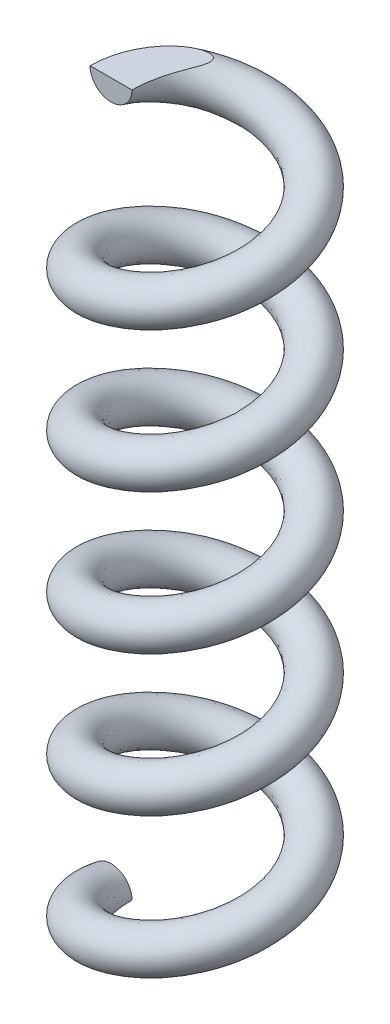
ISO-10303-21;
HEADER;
FILE_DESCRIPTION(('STEP AP214'),'2;1');
FILE_NAME('part.step','',(''),(''),'','','');
FILE_SCHEMA(('AUTOMOTIVE_DESIGN { 1 0 10303 214 1 1 1 1 }'));
ENDSEC;
DATA;
#1=APPLICATION_CONTEXT('core data for automotive mechanical design processes');
#2=APPLICATION_PROTOCOL_DEFINITION('international standard','automotive_design',2000,#1);
#3=PRODUCT_CONTEXT('',#1,'mechanical');
#4=PRODUCT('Part','Part','',(#3));
#5=PRODUCT_RELATED_PRODUCT_CATEGORY('part','',(#4));
#6=PRODUCT_DEFINITION_FORMATION('','',#4);
#7=PRODUCT_DEFINITION_CONTEXT('part definition',#1,'design');
#8=PRODUCT_DEFINITION('design','',#6,#7);
#9=PRODUCT_DEFINITION_SHAPE('','',#8);
#10=(LENGTH_UNIT() NAMED_UNIT(*) SI_UNIT(.MILLI.,.METRE.));
#11=(NAMED_UNIT(*) PLANE_ANGLE_UNIT() SI_UNIT($,.RADIAN.));
#12=(NAMED_UNIT(*) SI_UNIT($,.STERADIAN.) SOLID_ANGLE_UNIT());
#13=UNCERTAINTY_MEASURE_WITH_UNIT(LENGTH_MEASURE(1.E-05),#10,'distance_accuracy_value','');
#14=(GEOMETRIC_REPRESENTATION_CONTEXT(3) GLOBAL_UNCERTAINTY_ASSIGNED_CONTEXT((#13)) GLOBAL_UNIT_ASSIGNED_CONTEXT((#10,
#11,#12)) REPRESENTATION_CONTEXT('',''));
#15=CARTESIAN_POINT('',(0.,0.,0.));
#16=DIRECTION('',(0.,0.,1.));
#17=DIRECTION('',(1.,0.,0.));
#18=AXIS2_PLACEMENT_3D('',#15,#16,#17);
#19=CARTESIAN_POINT('',(-38.,45.4784826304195,9.77614774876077E-13));
#20=DIRECTION('',(0.,0.,1.));
#21=DIRECTION('',(1.,0.,0.));
#22=AXIS2_PLACEMENT_3D('',#19,#20,#21);
#23=PLANE('',#22);
#24=CARTESIAN_POINT('',(-38.,45.4784826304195,9.77614774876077E-13));
#25=DIRECTION('',(0.,0.,1.));
#26=DIRECTION('',(1.,0.,0.));
#27=AXIS2_PLACEMENT_3D('',#24,#25,#26);
#28=CIRCLE('',#27,3.5);
#29=CARTESIAN_POINT('',(-41.5,45.4784826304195,0.));
#30=VERTEX_POINT('',#29);
#31=CARTESIAN_POINT('',(-34.5,45.4784826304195,7.33211081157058E-13));
#32=VERTEX_POINT('',#31);
#33=EDGE_CURVE('E75',#30,#32,#28,.T.);
#34=ORIENTED_EDGE('',*,*,#33,.T.);
#35=DIRECTION('',(-1.,0.,0.));
#36=VECTOR('',#35,1.);
#37=CARTESIAN_POINT('',(-38.,45.4784826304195,9.77614774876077E-13));
#38=LINE('',#37,#36);
#39=EDGE_CURVE('E61',#32,#30,#38,.T.);
#40=ORIENTED_EDGE('',*,*,#39,.T.);
#41=EDGE_LOOP('',(#34,#40));
#42=FACE_BOUND('',#41,.T.);
#43=ADVANCED_FACE('F41',(#42),#23,.T.);
#44=CARTESIAN_POINT('',(-34.5,-71.5,0.));
#45=CARTESIAN_POINT('',(-34.5,-70.3302151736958,3.41165681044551));
#46=CARTESIAN_POINT('',(-32.4946784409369,-69.1604303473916,6.17174514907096));
#47=CARTESIAN_POINT('',(-30.4893568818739,-67.9906455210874,8.93183348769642));
#48=CARTESIAN_POINT('',(-27.2446784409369,-66.8208606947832,9.98609342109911));
#49=CARTESIAN_POINT('',(-24.,-65.651075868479,11.0403533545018));
#50=CARTESIAN_POINT('',(-20.7553215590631,-64.4812910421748,9.98609342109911));
#51=CARTESIAN_POINT('',(-17.5106431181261,-63.3115062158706,8.93183348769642));
#52=CARTESIAN_POINT('',(-15.5053215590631,-62.1417213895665,6.17174514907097));
#53=CARTESIAN_POINT('',(-13.5,-60.9719365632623,3.41165681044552));
#54=CARTESIAN_POINT('',(-13.5,-59.8021517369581,0.));
#55=CARTESIAN_POINT('',(-13.5,-58.6323669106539,-3.41165681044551));
#56=CARTESIAN_POINT('',(-15.5053215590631,-57.4625820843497,-6.17174514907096));
#57=CARTESIAN_POINT('',(-17.5106431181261,-56.2927972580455,-8.93183348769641));
#58=CARTESIAN_POINT('',(-20.7553215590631,-55.1230124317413,-9.98609342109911));
#59=CARTESIAN_POINT('',(-24.,-53.9532276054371,-11.0403533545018));
#60=CARTESIAN_POINT('',(-27.2446784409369,-52.7834427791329,-9.98609342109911));
#61=CARTESIAN_POINT('',(-30.4893568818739,-51.6136579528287,-8.93183348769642));
#62=CARTESIAN_POINT('',(-32.4946784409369,-50.4438731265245,-6.17174514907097));
#63=CARTESIAN_POINT('',(-34.5,-49.2740883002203,-3.41165681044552));
#64=CARTESIAN_POINT('',(-34.5,-48.1043034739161,0.));
#65=CARTESIAN_POINT('',(-34.5,-46.934518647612,3.41165681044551));
#66=CARTESIAN_POINT('',(-32.4946784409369,-45.7647338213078,6.17174514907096));
#67=CARTESIAN_POINT('',(-30.4893568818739,-44.5949489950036,8.93183348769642));
#68=CARTESIAN_POINT('',(-27.2446784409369,-43.4251641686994,9.98609342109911));
#69=CARTESIAN_POINT('',(-24.,-42.2553793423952,11.0403533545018));
#70=CARTESIAN_POINT('',(-20.7553215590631,-41.085594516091,9.98609342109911));
#71=CARTESIAN_POINT('',(-17.5106431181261,-39.9158096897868,8.93183348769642));
#72=CARTESIAN_POINT('',(-15.5053215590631,-38.7460248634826,6.17174514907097));
#73=CARTESIAN_POINT('',(-13.5,-37.5762400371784,3.41165681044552));
#74=CARTESIAN_POINT('',(-13.5,-36.4064552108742,0.));
#75=CARTESIAN_POINT('',(-13.5,-35.23667038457,-3.41165681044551));
#76=CARTESIAN_POINT('',(-15.5053215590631,-34.0668855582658,-6.17174514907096));
#77=CARTESIAN_POINT('',(-17.5106431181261,-32.8971007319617,-8.93183348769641));
#78=CARTESIAN_POINT('',(-20.7553215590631,-31.7273159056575,-9.98609342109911));
#79=CARTESIAN_POINT('',(-24.,-30.5575310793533,-11.0403533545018));
#80=CARTESIAN_POINT('',(-27.2446784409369,-29.3877462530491,-9.98609342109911));
#81=CARTESIAN_POINT('',(-30.4893568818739,-28.2179614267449,-8.93183348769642));
#82=CARTESIAN_POINT('',(-32.4946784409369,-27.0481766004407,-6.17174514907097));
#83=CARTESIAN_POINT('',(-34.5,-25.8783917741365,-3.41165681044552));
#84=CARTESIAN_POINT('',(-34.5,-24.7086069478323,0.));
#85=CARTESIAN_POINT('',(-34.5,-23.5388221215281,3.41165681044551));
#86=CARTESIAN_POINT('',(-32.4946784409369,-22.3690372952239,6.17174514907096));
#87=CARTESIAN_POINT('',(-30.4893568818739,-21.1992524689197,8.93183348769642));
#88=CARTESIAN_POINT('',(-27.2446784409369,-20.0294676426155,9.98609342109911));
#89=CARTESIAN_POINT('',(-24.,-18.8596828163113,11.0403533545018));
#90=CARTESIAN_POINT('',(-20.7553215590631,-17.6898979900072,9.98609342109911));
#91=CARTESIAN_POINT('',(-17.5106431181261,-16.520113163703,8.93183348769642));
#92=CARTESIAN_POINT('',(-15.5053215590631,-15.3503283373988,6.17174514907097));
#93=CARTESIAN_POINT('',(-13.5,-14.1805435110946,3.41165681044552));
#94=CARTESIAN_POINT('',(-13.5,-13.0107586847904,0.));
#95=CARTESIAN_POINT('',(-13.5,-11.8409738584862,-3.41165681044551));
#96=CARTESIAN_POINT('',(-15.5053215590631,-10.671189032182,-6.17174514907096));
#97=CARTESIAN_POINT('',(-17.5106431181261,-9.50140420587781,-8.93183348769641));
#98=CARTESIAN_POINT('',(-20.7553215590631,-8.33161937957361,-9.98609342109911));
#99=CARTESIAN_POINT('',(-24.,-7.16183455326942,-11.0403533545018));
#100=CARTESIAN_POINT('',(-27.2446784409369,-5.99204972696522,-9.98609342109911));
#101=CARTESIAN_POINT('',(-30.4893568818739,-4.82226490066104,-8.93183348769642));
#102=CARTESIAN_POINT('',(-32.4946784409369,-3.65248007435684,-6.17174514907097));
#103=CARTESIAN_POINT('',(-34.5,-2.48269524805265,-3.41165681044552));
#104=CARTESIAN_POINT('',(-34.5,-1.31291042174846,0.));
#105=CARTESIAN_POINT('',(-34.5,-0.143125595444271,3.41165681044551));
#106=CARTESIAN_POINT('',(-32.4946784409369,1.02665923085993,6.17174514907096));
#107=CARTESIAN_POINT('',(-30.4893568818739,2.19644405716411,8.93183348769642));
#108=CARTESIAN_POINT('',(-27.2446784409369,3.36622888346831,9.98609342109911));
#109=CARTESIAN_POINT('',(-24.,4.53601370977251,11.0403533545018));
#110=CARTESIAN_POINT('',(-20.7553215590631,5.70579853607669,9.98609342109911));
#111=CARTESIAN_POINT('',(-17.5106431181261,6.87558336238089,8.93183348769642));
#112=CARTESIAN_POINT('',(-15.5053215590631,8.04536818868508,6.17174514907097));
#113=CARTESIAN_POINT('',(-13.5,9.21515301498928,3.41165681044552));
#114=CARTESIAN_POINT('',(-13.5,10.3849378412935,0.));
#115=CARTESIAN_POINT('',(-13.5,11.5547226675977,-3.41165681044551));
#116=CARTESIAN_POINT('',(-15.5053215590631,12.7245074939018,-6.17174514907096));
#117=CARTESIAN_POINT('',(-17.5106431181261,13.894292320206,-8.93183348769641));
#118=CARTESIAN_POINT('',(-20.7553215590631,15.0640771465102,-9.98609342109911));
#119=CARTESIAN_POINT('',(-24.,16.2338619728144,-11.0403533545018));
#120=CARTESIAN_POINT('',(-27.2446784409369,17.4036467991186,-9.98609342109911));
#121=CARTESIAN_POINT('',(-30.4893568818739,18.5734316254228,-8.93183348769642));
#122=CARTESIAN_POINT('',(-32.4946784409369,19.743216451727,-6.17174514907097));
#123=CARTESIAN_POINT('',(-34.5,20.9130012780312,-3.41165681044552));
#124=CARTESIAN_POINT('',(-34.5,22.0827861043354,0.));
#125=CARTESIAN_POINT('',(-34.5,23.2525709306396,3.41165681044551));
#126=CARTESIAN_POINT('',(-32.4946784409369,24.4223557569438,6.17174514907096));
#127=CARTESIAN_POINT('',(-30.4893568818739,25.592140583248,8.93183348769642));
#128=CARTESIAN_POINT('',(-27.2446784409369,26.7619254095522,9.98609342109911));
#129=CARTESIAN_POINT('',(-24.,27.9317102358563,11.0403533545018));
#130=CARTESIAN_POINT('',(-20.7553215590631,29.1014950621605,9.98609342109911));
#131=CARTESIAN_POINT('',(-17.5106431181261,30.2712798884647,8.93183348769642));
#132=CARTESIAN_POINT('',(-15.5053215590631,31.4410647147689,6.17174514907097));
#133=CARTESIAN_POINT('',(-13.5,32.6108495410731,3.41165681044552));
#134=CARTESIAN_POINT('',(-13.5,33.7806343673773,0.));
#135=CARTESIAN_POINT('',(-13.5,34.9504191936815,-3.41165681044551));
#136=CARTESIAN_POINT('',(-15.5053215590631,36.1202040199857,-6.17174514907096));
#137=CARTESIAN_POINT('',(-17.5106431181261,37.2899888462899,-8.93183348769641));
#138=CARTESIAN_POINT('',(-20.7553215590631,38.4597736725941,-9.98609342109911));
#139=CARTESIAN_POINT('',(-24.,39.6295584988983,-11.0403533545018));
#140=CARTESIAN_POINT('',(-27.2446784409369,40.7993433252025,-9.98609342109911));
#141=CARTESIAN_POINT('',(-30.4893568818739,41.9691281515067,-8.93183348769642));
#142=CARTESIAN_POINT('',(-32.4946784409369,43.1389129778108,-6.17174514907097));
#143=CARTESIAN_POINT('',(-34.5,44.308697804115,-3.41165681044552));
#144=CARTESIAN_POINT('',(-34.5,45.4784826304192,0.));
#145=CARTESIAN_POINT('',(-34.5,-64.5,0.));
#146=CARTESIAN_POINT('',(-34.5,-63.3302151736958,3.41165681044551));
#147=CARTESIAN_POINT('',(-32.4946784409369,-62.1604303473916,6.17174514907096));
#148=CARTESIAN_POINT('',(-30.4893568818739,-60.9906455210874,8.93183348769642));
#149=CARTESIAN_POINT('',(-27.2446784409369,-59.8208606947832,9.98609342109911));
#150=CARTESIAN_POINT('',(-24.,-58.651075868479,11.0403533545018));
#151=CARTESIAN_POINT('',(-20.7553215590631,-57.4812910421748,9.98609342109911));
#152=CARTESIAN_POINT('',(-17.5106431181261,-56.3115062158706,8.93183348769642));
#153=CARTESIAN_POINT('',(-15.5053215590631,-55.1417213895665,6.17174514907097));
#154=CARTESIAN_POINT('',(-13.5,-53.9719365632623,3.41165681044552));
#155=CARTESIAN_POINT('',(-13.5,-52.8021517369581,0.));
#156=CARTESIAN_POINT('',(-13.5,-51.6323669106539,-3.41165681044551));
#157=CARTESIAN_POINT('',(-15.5053215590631,-50.4625820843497,-6.17174514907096));
#158=CARTESIAN_POINT('',(-17.5106431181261,-49.2927972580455,-8.93183348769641));
#159=CARTESIAN_POINT('',(-20.7553215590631,-48.1230124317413,-9.98609342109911));
#160=CARTESIAN_POINT('',(-24.,-46.9532276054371,-11.0403533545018));
#161=CARTESIAN_POINT('',(-27.2446784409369,-45.7834427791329,-9.98609342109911));
#162=CARTESIAN_POINT('',(-30.4893568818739,-44.6136579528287,-8.93183348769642));
#163=CARTESIAN_POINT('',(-32.4946784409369,-43.4438731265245,-6.17174514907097));
#164=CARTESIAN_POINT('',(-34.5,-42.2740883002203,-3.41165681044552));
#165=CARTESIAN_POINT('',(-34.5,-41.1043034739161,0.));
#166=CARTESIAN_POINT('',(-34.5,-39.934518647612,3.41165681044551));
#167=CARTESIAN_POINT('',(-32.4946784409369,-38.7647338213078,6.17174514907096));
#168=CARTESIAN_POINT('',(-30.4893568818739,-37.5949489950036,8.93183348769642));
#169=CARTESIAN_POINT('',(-27.2446784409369,-36.4251641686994,9.98609342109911));
#170=CARTESIAN_POINT('',(-24.,-35.2553793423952,11.0403533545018));
#171=CARTESIAN_POINT('',(-20.7553215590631,-34.085594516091,9.98609342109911));
#172=CARTESIAN_POINT('',(-17.5106431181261,-32.9158096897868,8.93183348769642));
#173=CARTESIAN_POINT('',(-15.5053215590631,-31.7460248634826,6.17174514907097));
#174=CARTESIAN_POINT('',(-13.5,-30.5762400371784,3.41165681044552));
#175=CARTESIAN_POINT('',(-13.5,-29.4064552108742,0.));
#176=CARTESIAN_POINT('',(-13.5,-28.23667038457,-3.41165681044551));
#177=CARTESIAN_POINT('',(-15.5053215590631,-27.0668855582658,-6.17174514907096));
#178=CARTESIAN_POINT('',(-17.5106431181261,-25.8971007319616,-8.93183348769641));
#179=CARTESIAN_POINT('',(-20.7553215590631,-24.7273159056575,-9.98609342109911));
#180=CARTESIAN_POINT('',(-24.,-23.5575310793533,-11.0403533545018));
#181=CARTESIAN_POINT('',(-27.2446784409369,-22.3877462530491,-9.98609342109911));
#182=CARTESIAN_POINT('',(-30.4893568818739,-21.2179614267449,-8.93183348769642));
#183=CARTESIAN_POINT('',(-32.4946784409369,-20.0481766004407,-6.17174514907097));
#184=CARTESIAN_POINT('',(-34.5,-18.8783917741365,-3.41165681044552));
#185=CARTESIAN_POINT('',(-34.5,-17.7086069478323,0.));
#186=CARTESIAN_POINT('',(-34.5,-16.5388221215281,3.41165681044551));
#187=CARTESIAN_POINT('',(-32.4946784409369,-15.3690372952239,6.17174514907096));
#188=CARTESIAN_POINT('',(-30.4893568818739,-14.1992524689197,8.93183348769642));
#189=CARTESIAN_POINT('',(-27.2446784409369,-13.0294676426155,9.98609342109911));
#190=CARTESIAN_POINT('',(-24.,-11.8596828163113,11.0403533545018));
#191=CARTESIAN_POINT('',(-20.7553215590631,-10.6898979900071,9.98609342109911));
#192=CARTESIAN_POINT('',(-17.5106431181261,-9.52011316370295,8.93183348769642));
#193=CARTESIAN_POINT('',(-15.5053215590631,-8.35032833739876,6.17174514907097));
#194=CARTESIAN_POINT('',(-13.5,-7.18054351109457,3.41165681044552));
#195=CARTESIAN_POINT('',(-13.5,-6.01075868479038,0.));
#196=CARTESIAN_POINT('',(-13.5,-4.84097385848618,-3.41165681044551));
#197=CARTESIAN_POINT('',(-15.5053215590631,-3.67118903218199,-6.17174514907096));
#198=CARTESIAN_POINT('',(-17.5106431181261,-2.5014042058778,-8.93183348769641));
#199=CARTESIAN_POINT('',(-20.7553215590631,-1.3316193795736,-9.98609342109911));
#200=CARTESIAN_POINT('',(-24.,-0.161834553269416,-11.0403533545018));
#201=CARTESIAN_POINT('',(-27.2446784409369,1.00795027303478,-9.98609342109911));
#202=CARTESIAN_POINT('',(-30.4893568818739,2.17773509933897,-8.93183348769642));
#203=CARTESIAN_POINT('',(-32.4946784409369,3.34751992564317,-6.17174514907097));
#204=CARTESIAN_POINT('',(-34.5,4.51730475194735,-3.41165681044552));
#205=CARTESIAN_POINT('',(-34.5,5.68708957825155,0.));
#206=CARTESIAN_POINT('',(-34.5,6.85687440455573,3.41165681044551));
#207=CARTESIAN_POINT('',(-32.4946784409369,8.02665923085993,6.17174514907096));
#208=CARTESIAN_POINT('',(-30.4893568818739,9.19644405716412,8.93183348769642));
#209=CARTESIAN_POINT('',(-27.2446784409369,10.3662288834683,9.98609342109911));
#210=CARTESIAN_POINT('',(-24.,11.5360137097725,11.0403533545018));
#211=CARTESIAN_POINT('',(-20.7553215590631,12.7057985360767,9.98609342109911));
#212=CARTESIAN_POINT('',(-17.5106431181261,13.8755833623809,8.93183348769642));
#213=CARTESIAN_POINT('',(-15.5053215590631,15.0453681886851,6.17174514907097));
#214=CARTESIAN_POINT('',(-13.5,16.2151530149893,3.41165681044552));
#215=CARTESIAN_POINT('',(-13.5,17.3849378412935,0.));
#216=CARTESIAN_POINT('',(-13.5,18.5547226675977,-3.41165681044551));
#217=CARTESIAN_POINT('',(-15.5053215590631,19.7245074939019,-6.17174514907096));
#218=CARTESIAN_POINT('',(-17.5106431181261,20.8942923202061,-8.93183348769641));
#219=CARTESIAN_POINT('',(-20.7553215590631,22.0640771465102,-9.98609342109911));
#220=CARTESIAN_POINT('',(-24.,23.2338619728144,-11.0403533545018));
#221=CARTESIAN_POINT('',(-27.2446784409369,24.4036467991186,-9.98609342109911));
#222=CARTESIAN_POINT('',(-30.4893568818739,25.5734316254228,-8.93183348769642));
#223=CARTESIAN_POINT('',(-32.4946784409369,26.743216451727,-6.17174514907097));
#224=CARTESIAN_POINT('',(-34.5,27.9130012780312,-3.41165681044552));
#225=CARTESIAN_POINT('',(-34.5,29.0827861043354,0.));
#226=CARTESIAN_POINT('',(-34.5,30.2525709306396,3.41165681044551));
#227=CARTESIAN_POINT('',(-32.4946784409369,31.4223557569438,6.17174514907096));
#228=CARTESIAN_POINT('',(-30.4893568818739,32.592140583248,8.93183348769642));
#229=CARTESIAN_POINT('',(-27.2446784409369,33.7619254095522,9.98609342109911));
#230=CARTESIAN_POINT('',(-24.,34.9317102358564,11.0403533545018));
#231=CARTESIAN_POINT('',(-20.7553215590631,36.1014950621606,9.98609342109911));
#232=CARTESIAN_POINT('',(-17.5106431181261,37.2712798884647,8.93183348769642));
#233=CARTESIAN_POINT('',(-15.5053215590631,38.4410647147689,6.17174514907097));
#234=CARTESIAN_POINT('',(-13.5,39.6108495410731,3.41165681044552));
#235=CARTESIAN_POINT('',(-13.5,40.7806343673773,0.));
#236=CARTESIAN_POINT('',(-13.5,41.9504191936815,-3.41165681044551));
#237=CARTESIAN_POINT('',(-15.5053215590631,43.1202040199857,-6.17174514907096));
#238=CARTESIAN_POINT('',(-17.5106431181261,44.2899888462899,-8.93183348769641));
#239=CARTESIAN_POINT('',(-20.7553215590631,45.4597736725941,-9.98609342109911));
#240=CARTESIAN_POINT('',(-24.,46.6295584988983,-11.0403533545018));
#241=CARTESIAN_POINT('',(-27.2446784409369,47.7993433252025,-9.98609342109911));
#242=CARTESIAN_POINT('',(-30.4893568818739,48.9691281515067,-8.93183348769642));
#243=CARTESIAN_POINT('',(-32.4946784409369,50.1389129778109,-6.17174514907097));
#244=CARTESIAN_POINT('',(-34.5,51.3086978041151,-3.41165681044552));
#245=CARTESIAN_POINT('',(-34.5,52.4784826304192,0.));
#246=CARTESIAN_POINT('',(-41.5,-64.5,0.));
#247=CARTESIAN_POINT('',(-41.5,-63.3302151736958,5.68609468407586));
#248=CARTESIAN_POINT('',(-38.1577974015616,-62.1604303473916,10.2862419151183));
#249=CARTESIAN_POINT('',(-34.8155948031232,-60.9906455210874,14.8863891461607));
#250=CARTESIAN_POINT('',(-29.4077974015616,-59.8208606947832,16.6434890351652));
#251=CARTESIAN_POINT('',(-24.,-58.651075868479,18.4005889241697));
#252=CARTESIAN_POINT('',(-18.5922025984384,-57.4812910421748,16.6434890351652));
#253=CARTESIAN_POINT('',(-13.1844051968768,-56.3115062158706,14.8863891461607));
#254=CARTESIAN_POINT('',(-9.84220259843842,-55.1417213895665,10.2862419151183));
#255=CARTESIAN_POINT('',(-6.5,-53.9719365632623,5.68609468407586));
#256=CARTESIAN_POINT('',(-6.5,-52.8021517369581,0.));
#257=CARTESIAN_POINT('',(-6.5,-51.6323669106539,-5.68609468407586));
#258=CARTESIAN_POINT('',(-9.84220259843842,-50.4625820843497,-10.2862419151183));
#259=CARTESIAN_POINT('',(-13.1844051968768,-49.2927972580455,-14.8863891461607));
#260=CARTESIAN_POINT('',(-18.5922025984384,-48.1230124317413,-16.6434890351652));
#261=CARTESIAN_POINT('',(-24.,-46.9532276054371,-18.4005889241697));
#262=CARTESIAN_POINT('',(-29.4077974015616,-45.7834427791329,-16.6434890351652));
#263=CARTESIAN_POINT('',(-34.8155948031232,-44.6136579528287,-14.8863891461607));
#264=CARTESIAN_POINT('',(-38.1577974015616,-43.4438731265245,-10.2862419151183));
#265=CARTESIAN_POINT('',(-41.5,-42.2740883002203,-5.68609468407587));
#266=CARTESIAN_POINT('',(-41.5,-41.1043034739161,0.));
#267=CARTESIAN_POINT('',(-41.5,-39.934518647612,5.68609468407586));
#268=CARTESIAN_POINT('',(-38.1577974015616,-38.7647338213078,10.2862419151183));
#269=CARTESIAN_POINT('',(-34.8155948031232,-37.5949489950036,14.8863891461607));
#270=CARTESIAN_POINT('',(-29.4077974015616,-36.4251641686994,16.6434890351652));
#271=CARTESIAN_POINT('',(-24.,-35.2553793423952,18.4005889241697));
#272=CARTESIAN_POINT('',(-18.5922025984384,-34.085594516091,16.6434890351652));
#273=CARTESIAN_POINT('',(-13.1844051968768,-32.9158096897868,14.8863891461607));
#274=CARTESIAN_POINT('',(-9.84220259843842,-31.7460248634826,10.2862419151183));
#275=CARTESIAN_POINT('',(-6.5,-30.5762400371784,5.68609468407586));
#276=CARTESIAN_POINT('',(-6.5,-29.4064552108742,0.));
#277=CARTESIAN_POINT('',(-6.5,-28.23667038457,-5.68609468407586));
#278=CARTESIAN_POINT('',(-9.84220259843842,-27.0668855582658,-10.2862419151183));
#279=CARTESIAN_POINT('',(-13.1844051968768,-25.8971007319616,-14.8863891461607));
#280=CARTESIAN_POINT('',(-18.5922025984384,-24.7273159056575,-16.6434890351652));
#281=CARTESIAN_POINT('',(-24.,-23.5575310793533,-18.4005889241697));
#282=CARTESIAN_POINT('',(-29.4077974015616,-22.3877462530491,-16.6434890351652));
#283=CARTESIAN_POINT('',(-34.8155948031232,-21.2179614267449,-14.8863891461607));
#284=CARTESIAN_POINT('',(-38.1577974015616,-20.0481766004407,-10.2862419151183));
#285=CARTESIAN_POINT('',(-41.5,-18.8783917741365,-5.68609468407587));
#286=CARTESIAN_POINT('',(-41.5,-17.7086069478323,0.));
#287=CARTESIAN_POINT('',(-41.5,-16.5388221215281,5.68609468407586));
#288=CARTESIAN_POINT('',(-38.1577974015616,-15.3690372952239,10.2862419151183));
#289=CARTESIAN_POINT('',(-34.8155948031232,-14.1992524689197,14.8863891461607));
#290=CARTESIAN_POINT('',(-29.4077974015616,-13.0294676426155,16.6434890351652));
#291=CARTESIAN_POINT('',(-24.,-11.8596828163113,18.4005889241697));
#292=CARTESIAN_POINT('',(-18.5922025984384,-10.6898979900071,16.6434890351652));
#293=CARTESIAN_POINT('',(-13.1844051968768,-9.52011316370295,14.8863891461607));
#294=CARTESIAN_POINT('',(-9.84220259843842,-8.35032833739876,10.2862419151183));
#295=CARTESIAN_POINT('',(-6.5,-7.18054351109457,5.68609468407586));
#296=CARTESIAN_POINT('',(-6.5,-6.01075868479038,0.));
#297=CARTESIAN_POINT('',(-6.5,-4.84097385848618,-5.68609468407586));
#298=CARTESIAN_POINT('',(-9.84220259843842,-3.67118903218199,-10.2862419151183));
#299=CARTESIAN_POINT('',(-13.1844051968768,-2.5014042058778,-14.8863891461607));
#300=CARTESIAN_POINT('',(-18.5922025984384,-1.3316193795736,-16.6434890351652));
#301=CARTESIAN_POINT('',(-24.,-0.161834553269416,-18.4005889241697));
#302=CARTESIAN_POINT('',(-29.4077974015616,1.00795027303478,-16.6434890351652));
#303=CARTESIAN_POINT('',(-34.8155948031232,2.17773509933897,-14.8863891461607));
#304=CARTESIAN_POINT('',(-38.1577974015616,3.34751992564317,-10.2862419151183));
#305=CARTESIAN_POINT('',(-41.5,4.51730475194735,-5.68609468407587));
#306=CARTESIAN_POINT('',(-41.5,5.68708957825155,0.));
#307=CARTESIAN_POINT('',(-41.5,6.85687440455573,5.68609468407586));
#308=CARTESIAN_POINT('',(-38.1577974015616,8.02665923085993,10.2862419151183));
#309=CARTESIAN_POINT('',(-34.8155948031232,9.19644405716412,14.8863891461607));
#310=CARTESIAN_POINT('',(-29.4077974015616,10.3662288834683,16.6434890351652));
#311=CARTESIAN_POINT('',(-24.,11.5360137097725,18.4005889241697));
#312=CARTESIAN_POINT('',(-18.5922025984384,12.7057985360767,16.6434890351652));
#313=CARTESIAN_POINT('',(-13.1844051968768,13.8755833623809,14.8863891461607));
#314=CARTESIAN_POINT('',(-9.84220259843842,15.0453681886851,10.2862419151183));
#315=CARTESIAN_POINT('',(-6.5,16.2151530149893,5.68609468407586));
#316=CARTESIAN_POINT('',(-6.5,17.3849378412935,0.));
#317=CARTESIAN_POINT('',(-6.5,18.5547226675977,-5.68609468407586));
#318=CARTESIAN_POINT('',(-9.84220259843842,19.7245074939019,-10.2862419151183));
#319=CARTESIAN_POINT('',(-13.1844051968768,20.8942923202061,-14.8863891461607));
#320=CARTESIAN_POINT('',(-18.5922025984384,22.0640771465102,-16.6434890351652));
#321=CARTESIAN_POINT('',(-24.,23.2338619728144,-18.4005889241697));
#322=CARTESIAN_POINT('',(-29.4077974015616,24.4036467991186,-16.6434890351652));
#323=CARTESIAN_POINT('',(-34.8155948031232,25.5734316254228,-14.8863891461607));
#324=CARTESIAN_POINT('',(-38.1577974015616,26.743216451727,-10.2862419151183));
#325=CARTESIAN_POINT('',(-41.5,27.9130012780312,-5.68609468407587));
#326=CARTESIAN_POINT('',(-41.5,29.0827861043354,0.));
#327=CARTESIAN_POINT('',(-41.5,30.2525709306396,5.68609468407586));
#328=CARTESIAN_POINT('',(-38.1577974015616,31.4223557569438,10.2862419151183));
#329=CARTESIAN_POINT('',(-34.8155948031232,32.592140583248,14.8863891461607));
#330=CARTESIAN_POINT('',(-29.4077974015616,33.7619254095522,16.6434890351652));
#331=CARTESIAN_POINT('',(-24.,34.9317102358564,18.4005889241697));
#332=CARTESIAN_POINT('',(-18.5922025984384,36.1014950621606,16.6434890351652));
#333=CARTESIAN_POINT('',(-13.1844051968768,37.2712798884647,14.8863891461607));
#334=CARTESIAN_POINT('',(-9.84220259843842,38.4410647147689,10.2862419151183));
#335=CARTESIAN_POINT('',(-6.5,39.6108495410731,5.68609468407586));
#336=CARTESIAN_POINT('',(-6.5,40.7806343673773,0.));
#337=CARTESIAN_POINT('',(-6.5,41.9504191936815,-5.68609468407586));
#338=CARTESIAN_POINT('',(-9.84220259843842,43.1202040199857,-10.2862419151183));
#339=CARTESIAN_POINT('',(-13.1844051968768,44.2899888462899,-14.8863891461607));
#340=CARTESIAN_POINT('',(-18.5922025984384,45.4597736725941,-16.6434890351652));
#341=CARTESIAN_POINT('',(-24.,46.6295584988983,-18.4005889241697));
#342=CARTESIAN_POINT('',(-29.4077974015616,47.7993433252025,-16.6434890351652));
#343=CARTESIAN_POINT('',(-34.8155948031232,48.9691281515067,-14.8863891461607));
#344=CARTESIAN_POINT('',(-38.1577974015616,50.1389129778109,-10.2862419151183));
#345=CARTESIAN_POINT('',(-41.5,51.3086978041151,-5.68609468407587));
#346=CARTESIAN_POINT('',(-41.5,52.4784826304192,0.));
#347=CARTESIAN_POINT('',(-41.5,-71.5,0.));
#348=CARTESIAN_POINT('',(-41.5,-70.3302151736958,5.68609468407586));
#349=CARTESIAN_POINT('',(-38.1577974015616,-69.1604303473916,10.2862419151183));
#350=CARTESIAN_POINT('',(-34.8155948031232,-67.9906455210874,14.8863891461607));
#351=CARTESIAN_POINT('',(-29.4077974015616,-66.8208606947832,16.6434890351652));
#352=CARTESIAN_POINT('',(-24.,-65.651075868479,18.4005889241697));
#353=CARTESIAN_POINT('',(-18.5922025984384,-64.4812910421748,16.6434890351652));
#354=CARTESIAN_POINT('',(-13.1844051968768,-63.3115062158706,14.8863891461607));
#355=CARTESIAN_POINT('',(-9.84220259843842,-62.1417213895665,10.2862419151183));
#356=CARTESIAN_POINT('',(-6.5,-60.9719365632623,5.68609468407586));
#357=CARTESIAN_POINT('',(-6.5,-59.8021517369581,0.));
#358=CARTESIAN_POINT('',(-6.5,-58.6323669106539,-5.68609468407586));
#359=CARTESIAN_POINT('',(-9.84220259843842,-57.4625820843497,-10.2862419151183));
#360=CARTESIAN_POINT('',(-13.1844051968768,-56.2927972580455,-14.8863891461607));
#361=CARTESIAN_POINT('',(-18.5922025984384,-55.1230124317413,-16.6434890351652));
#362=CARTESIAN_POINT('',(-24.,-53.9532276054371,-18.4005889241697));
#363=CARTESIAN_POINT('',(-29.4077974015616,-52.7834427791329,-16.6434890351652));
#364=CARTESIAN_POINT('',(-34.8155948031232,-51.6136579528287,-14.8863891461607));
#365=CARTESIAN_POINT('',(-38.1577974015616,-50.4438731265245,-10.2862419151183));
#366=CARTESIAN_POINT('',(-41.5,-49.2740883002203,-5.68609468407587));
#367=CARTESIAN_POINT('',(-41.5,-48.1043034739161,0.));
#368=CARTESIAN_POINT('',(-41.5,-46.934518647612,5.68609468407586));
#369=CARTESIAN_POINT('',(-38.1577974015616,-45.7647338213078,10.2862419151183));
#370=CARTESIAN_POINT('',(-34.8155948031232,-44.5949489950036,14.8863891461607));
#371=CARTESIAN_POINT('',(-29.4077974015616,-43.4251641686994,16.6434890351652));
#372=CARTESIAN_POINT('',(-24.,-42.2553793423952,18.4005889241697));
#373=CARTESIAN_POINT('',(-18.5922025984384,-41.085594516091,16.6434890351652));
#374=CARTESIAN_POINT('',(-13.1844051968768,-39.9158096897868,14.8863891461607));
#375=CARTESIAN_POINT('',(-9.84220259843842,-38.7460248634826,10.2862419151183));
#376=CARTESIAN_POINT('',(-6.5,-37.5762400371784,5.68609468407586));
#377=CARTESIAN_POINT('',(-6.5,-36.4064552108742,0.));
#378=CARTESIAN_POINT('',(-6.5,-35.23667038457,-5.68609468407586));
#379=CARTESIAN_POINT('',(-9.84220259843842,-34.0668855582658,-10.2862419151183));
#380=CARTESIAN_POINT('',(-13.1844051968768,-32.8971007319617,-14.8863891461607));
#381=CARTESIAN_POINT('',(-18.5922025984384,-31.7273159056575,-16.6434890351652));
#382=CARTESIAN_POINT('',(-24.,-30.5575310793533,-18.4005889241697));
#383=CARTESIAN_POINT('',(-29.4077974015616,-29.3877462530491,-16.6434890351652));
#384=CARTESIAN_POINT('',(-34.8155948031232,-28.2179614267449,-14.8863891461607));
#385=CARTESIAN_POINT('',(-38.1577974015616,-27.0481766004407,-10.2862419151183));
#386=CARTESIAN_POINT('',(-41.5,-25.8783917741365,-5.68609468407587));
#387=CARTESIAN_POINT('',(-41.5,-24.7086069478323,0.));
#388=CARTESIAN_POINT('',(-41.5,-23.5388221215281,5.68609468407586));
#389=CARTESIAN_POINT('',(-38.1577974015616,-22.3690372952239,10.2862419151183));
#390=CARTESIAN_POINT('',(-34.8155948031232,-21.1992524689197,14.8863891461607));
#391=CARTESIAN_POINT('',(-29.4077974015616,-20.0294676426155,16.6434890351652));
#392=CARTESIAN_POINT('',(-24.,-18.8596828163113,18.4005889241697));
#393=CARTESIAN_POINT('',(-18.5922025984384,-17.6898979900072,16.6434890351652));
#394=CARTESIAN_POINT('',(-13.1844051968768,-16.520113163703,14.8863891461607));
#395=CARTESIAN_POINT('',(-9.84220259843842,-15.3503283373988,10.2862419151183));
#396=CARTESIAN_POINT('',(-6.5,-14.1805435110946,5.68609468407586));
#397=CARTESIAN_POINT('',(-6.5,-13.0107586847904,0.));
#398=CARTESIAN_POINT('',(-6.5,-11.8409738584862,-5.68609468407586));
#399=CARTESIAN_POINT('',(-9.84220259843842,-10.671189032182,-10.2862419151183));
#400=CARTESIAN_POINT('',(-13.1844051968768,-9.50140420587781,-14.8863891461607));
#401=CARTESIAN_POINT('',(-18.5922025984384,-8.33161937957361,-16.6434890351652));
#402=CARTESIAN_POINT('',(-24.,-7.16183455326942,-18.4005889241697));
#403=CARTESIAN_POINT('',(-29.4077974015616,-5.99204972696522,-16.6434890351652));
#404=CARTESIAN_POINT('',(-34.8155948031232,-4.82226490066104,-14.8863891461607));
#405=CARTESIAN_POINT('',(-38.1577974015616,-3.65248007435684,-10.2862419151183));
#406=CARTESIAN_POINT('',(-41.5,-2.48269524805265,-5.68609468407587));
#407=CARTESIAN_POINT('',(-41.5,-1.31291042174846,0.));
#408=CARTESIAN_POINT('',(-41.5,-0.143125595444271,5.68609468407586));
#409=CARTESIAN_POINT('',(-38.1577974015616,1.02665923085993,10.2862419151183));
#410=CARTESIAN_POINT('',(-34.8155948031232,2.19644405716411,14.8863891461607));
#411=CARTESIAN_POINT('',(-29.4077974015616,3.36622888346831,16.6434890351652));
#412=CARTESIAN_POINT('',(-24.,4.53601370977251,18.4005889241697));
#413=CARTESIAN_POINT('',(-18.5922025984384,5.70579853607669,16.6434890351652));
#414=CARTESIAN_POINT('',(-13.1844051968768,6.87558336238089,14.8863891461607));
#415=CARTESIAN_POINT('',(-9.84220259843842,8.04536818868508,10.2862419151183));
#416=CARTESIAN_POINT('',(-6.5,9.21515301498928,5.68609468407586));
#417=CARTESIAN_POINT('',(-6.5,10.3849378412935,0.));
#418=CARTESIAN_POINT('',(-6.5,11.5547226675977,-5.68609468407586));
#419=CARTESIAN_POINT('',(-9.84220259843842,12.7245074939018,-10.2862419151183));
#420=CARTESIAN_POINT('',(-13.1844051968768,13.894292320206,-14.8863891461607));
#421=CARTESIAN_POINT('',(-18.5922025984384,15.0640771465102,-16.6434890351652));
#422=CARTESIAN_POINT('',(-24.,16.2338619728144,-18.4005889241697));
#423=CARTESIAN_POINT('',(-29.4077974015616,17.4036467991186,-16.6434890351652));
#424=CARTESIAN_POINT('',(-34.8155948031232,18.5734316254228,-14.8863891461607));
#425=CARTESIAN_POINT('',(-38.1577974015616,19.743216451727,-10.2862419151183));
#426=CARTESIAN_POINT('',(-41.5,20.9130012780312,-5.68609468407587));
#427=CARTESIAN_POINT('',(-41.5,22.0827861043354,0.));
#428=CARTESIAN_POINT('',(-41.5,23.2525709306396,5.68609468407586));
#429=CARTESIAN_POINT('',(-38.1577974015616,24.4223557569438,10.2862419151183));
#430=CARTESIAN_POINT('',(-34.8155948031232,25.592140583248,14.8863891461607));
#431=CARTESIAN_POINT('',(-29.4077974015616,26.7619254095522,16.6434890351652));
#432=CARTESIAN_POINT('',(-24.,27.9317102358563,18.4005889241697));
#433=CARTESIAN_POINT('',(-18.5922025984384,29.1014950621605,16.6434890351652));
#434=CARTESIAN_POINT('',(-13.1844051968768,30.2712798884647,14.8863891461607));
#435=CARTESIAN_POINT('',(-9.84220259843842,31.4410647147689,10.2862419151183));
#436=CARTESIAN_POINT('',(-6.5,32.6108495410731,5.68609468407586));
#437=CARTESIAN_POINT('',(-6.5,33.7806343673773,0.));
#438=CARTESIAN_POINT('',(-6.5,34.9504191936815,-5.68609468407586));
#439=CARTESIAN_POINT('',(-9.84220259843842,36.1202040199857,-10.2862419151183));
#440=CARTESIAN_POINT('',(-13.1844051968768,37.2899888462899,-14.8863891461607));
#441=CARTESIAN_POINT('',(-18.5922025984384,38.4597736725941,-16.6434890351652));
#442=CARTESIAN_POINT('',(-24.,39.6295584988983,-18.4005889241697));
#443=CARTESIAN_POINT('',(-29.4077974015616,40.7993433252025,-16.6434890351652));
#444=CARTESIAN_POINT('',(-34.8155948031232,41.9691281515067,-14.8863891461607));
#445=CARTESIAN_POINT('',(-38.1577974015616,43.1389129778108,-10.2862419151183));
#446=CARTESIAN_POINT('',(-41.5,44.308697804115,-5.68609468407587));
#447=CARTESIAN_POINT('',(-41.5,45.4784826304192,0.));
#448=CARTESIAN_POINT('',(-41.5,-78.5,0.));
#449=CARTESIAN_POINT('',(-41.5,-77.3302151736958,5.68609468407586));
#450=CARTESIAN_POINT('',(-38.1577974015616,-76.1604303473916,10.2862419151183));
#451=CARTESIAN_POINT('',(-34.8155948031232,-74.9906455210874,14.8863891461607));
#452=CARTESIAN_POINT('',(-29.4077974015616,-73.8208606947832,16.6434890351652));
#453=CARTESIAN_POINT('',(-24.,-72.651075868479,18.4005889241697));
#454=CARTESIAN_POINT('',(-18.5922025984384,-71.4812910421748,16.6434890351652));
#455=CARTESIAN_POINT('',(-13.1844051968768,-70.3115062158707,14.8863891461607));
#456=CARTESIAN_POINT('',(-9.84220259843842,-69.1417213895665,10.2862419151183));
#457=CARTESIAN_POINT('',(-6.5,-67.9719365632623,5.68609468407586));
#458=CARTESIAN_POINT('',(-6.5,-66.8021517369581,0.));
#459=CARTESIAN_POINT('',(-6.5,-65.6323669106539,-5.68609468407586));
#460=CARTESIAN_POINT('',(-9.84220259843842,-64.4625820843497,-10.2862419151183));
#461=CARTESIAN_POINT('',(-13.1844051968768,-63.2927972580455,-14.8863891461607));
#462=CARTESIAN_POINT('',(-18.5922025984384,-62.1230124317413,-16.6434890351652));
#463=CARTESIAN_POINT('',(-24.,-60.9532276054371,-18.4005889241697));
#464=CARTESIAN_POINT('',(-29.4077974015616,-59.7834427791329,-16.6434890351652));
#465=CARTESIAN_POINT('',(-34.8155948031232,-58.6136579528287,-14.8863891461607));
#466=CARTESIAN_POINT('',(-38.1577974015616,-57.4438731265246,-10.2862419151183));
#467=CARTESIAN_POINT('',(-41.5,-56.2740883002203,-5.68609468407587));
#468=CARTESIAN_POINT('',(-41.5,-55.1043034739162,0.));
#469=CARTESIAN_POINT('',(-41.5,-53.934518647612,5.68609468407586));
#470=CARTESIAN_POINT('',(-38.1577974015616,-52.7647338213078,10.2862419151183));
#471=CARTESIAN_POINT('',(-34.8155948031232,-51.5949489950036,14.8863891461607));
#472=CARTESIAN_POINT('',(-29.4077974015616,-50.4251641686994,16.6434890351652));
#473=CARTESIAN_POINT('',(-24.,-49.2553793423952,18.4005889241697));
#474=CARTESIAN_POINT('',(-18.5922025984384,-48.085594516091,16.6434890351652));
#475=CARTESIAN_POINT('',(-13.1844051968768,-46.9158096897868,14.8863891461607));
#476=CARTESIAN_POINT('',(-9.84220259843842,-45.7460248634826,10.2862419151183));
#477=CARTESIAN_POINT('',(-6.5,-44.5762400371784,5.68609468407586));
#478=CARTESIAN_POINT('',(-6.5,-43.4064552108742,0.));
#479=CARTESIAN_POINT('',(-6.5,-42.23667038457,-5.68609468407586));
#480=CARTESIAN_POINT('',(-9.84220259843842,-41.0668855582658,-10.2862419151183));
#481=CARTESIAN_POINT('',(-13.1844051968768,-39.8971007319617,-14.8863891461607));
#482=CARTESIAN_POINT('',(-18.5922025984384,-38.7273159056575,-16.6434890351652));
#483=CARTESIAN_POINT('',(-24.,-37.5575310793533,-18.4005889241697));
#484=CARTESIAN_POINT('',(-29.4077974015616,-36.3877462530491,-16.6434890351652));
#485=CARTESIAN_POINT('',(-34.8155948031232,-35.2179614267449,-14.8863891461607));
#486=CARTESIAN_POINT('',(-38.1577974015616,-34.0481766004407,-10.2862419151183));
#487=CARTESIAN_POINT('',(-41.5,-32.8783917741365,-5.68609468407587));
#488=CARTESIAN_POINT('',(-41.5,-31.7086069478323,0.));
#489=CARTESIAN_POINT('',(-41.5,-30.5388221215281,5.68609468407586));
#490=CARTESIAN_POINT('',(-38.1577974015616,-29.3690372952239,10.2862419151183));
#491=CARTESIAN_POINT('',(-34.8155948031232,-28.1992524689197,14.8863891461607));
#492=CARTESIAN_POINT('',(-29.4077974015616,-27.0294676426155,16.6434890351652));
#493=CARTESIAN_POINT('',(-24.,-25.8596828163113,18.4005889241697));
#494=CARTESIAN_POINT('',(-18.5922025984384,-24.6898979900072,16.6434890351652));
#495=CARTESIAN_POINT('',(-13.1844051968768,-23.520113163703,14.8863891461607));
#496=CARTESIAN_POINT('',(-9.84220259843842,-22.3503283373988,10.2862419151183));
#497=CARTESIAN_POINT('',(-6.5,-21.1805435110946,5.68609468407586));
#498=CARTESIAN_POINT('',(-6.5,-20.0107586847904,0.));
#499=CARTESIAN_POINT('',(-6.5,-18.8409738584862,-5.68609468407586));
#500=CARTESIAN_POINT('',(-9.84220259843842,-17.671189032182,-10.2862419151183));
#501=CARTESIAN_POINT('',(-13.1844051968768,-16.5014042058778,-14.8863891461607));
#502=CARTESIAN_POINT('',(-18.5922025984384,-15.3316193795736,-16.6434890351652));
#503=CARTESIAN_POINT('',(-24.,-14.1618345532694,-18.4005889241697));
#504=CARTESIAN_POINT('',(-29.4077974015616,-12.9920497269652,-16.6434890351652));
#505=CARTESIAN_POINT('',(-34.8155948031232,-11.822264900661,-14.8863891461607));
#506=CARTESIAN_POINT('',(-38.1577974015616,-10.6524800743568,-10.2862419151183));
#507=CARTESIAN_POINT('',(-41.5,-9.48269524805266,-5.68609468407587));
#508=CARTESIAN_POINT('',(-41.5,-8.31291042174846,0.));
#509=CARTESIAN_POINT('',(-41.5,-7.14312559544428,5.68609468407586));
#510=CARTESIAN_POINT('',(-38.1577974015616,-5.97334076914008,10.2862419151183));
#511=CARTESIAN_POINT('',(-34.8155948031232,-4.80355594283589,14.8863891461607));
#512=CARTESIAN_POINT('',(-29.4077974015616,-3.63377111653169,16.6434890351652));
#513=CARTESIAN_POINT('',(-24.,-2.4639862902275,18.4005889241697));
#514=CARTESIAN_POINT('',(-18.5922025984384,-1.29420146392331,16.6434890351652));
#515=CARTESIAN_POINT('',(-13.1844051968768,-0.124416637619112,14.8863891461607));
#516=CARTESIAN_POINT('',(-9.84220259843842,1.04536818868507,10.2862419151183));
#517=CARTESIAN_POINT('',(-6.5,2.21515301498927,5.68609468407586));
#518=CARTESIAN_POINT('',(-6.5,3.38493784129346,0.));
#519=CARTESIAN_POINT('',(-6.5,4.55472266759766,-5.68609468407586));
#520=CARTESIAN_POINT('',(-9.84220259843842,5.72450749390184,-10.2862419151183));
#521=CARTESIAN_POINT('',(-13.1844051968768,6.89429232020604,-14.8863891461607));
#522=CARTESIAN_POINT('',(-18.5922025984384,8.06407714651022,-16.6434890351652));
#523=CARTESIAN_POINT('',(-24.,9.23386197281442,-18.4005889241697));
#524=CARTESIAN_POINT('',(-29.4077974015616,10.4036467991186,-16.6434890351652));
#525=CARTESIAN_POINT('',(-34.8155948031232,11.5734316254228,-14.8863891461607));
#526=CARTESIAN_POINT('',(-38.1577974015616,12.743216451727,-10.2862419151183));
#527=CARTESIAN_POINT('',(-41.5,13.9130012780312,-5.68609468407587));
#528=CARTESIAN_POINT('',(-41.5,15.0827861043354,0.));
#529=CARTESIAN_POINT('',(-41.5,16.2525709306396,5.68609468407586));
#530=CARTESIAN_POINT('',(-38.1577974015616,17.4223557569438,10.2862419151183));
#531=CARTESIAN_POINT('',(-34.8155948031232,18.592140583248,14.8863891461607));
#532=CARTESIAN_POINT('',(-29.4077974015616,19.7619254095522,16.6434890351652));
#533=CARTESIAN_POINT('',(-24.,20.9317102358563,18.4005889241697));
#534=CARTESIAN_POINT('',(-18.5922025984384,22.1014950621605,16.6434890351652));
#535=CARTESIAN_POINT('',(-13.1844051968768,23.2712798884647,14.8863891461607));
#536=CARTESIAN_POINT('',(-9.84220259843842,24.4410647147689,10.2862419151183));
#537=CARTESIAN_POINT('',(-6.5,25.6108495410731,5.68609468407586));
#538=CARTESIAN_POINT('',(-6.5,26.7806343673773,0.));
#539=CARTESIAN_POINT('',(-6.5,27.9504191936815,-5.68609468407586));
#540=CARTESIAN_POINT('',(-9.84220259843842,29.1202040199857,-10.2862419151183));
#541=CARTESIAN_POINT('',(-13.1844051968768,30.2899888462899,-14.8863891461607));
#542=CARTESIAN_POINT('',(-18.5922025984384,31.4597736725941,-16.6434890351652));
#543=CARTESIAN_POINT('',(-24.,32.6295584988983,-18.4005889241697));
#544=CARTESIAN_POINT('',(-29.4077974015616,33.7993433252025,-16.6434890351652));
#545=CARTESIAN_POINT('',(-34.8155948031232,34.9691281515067,-14.8863891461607));
#546=CARTESIAN_POINT('',(-38.1577974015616,36.1389129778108,-10.2862419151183));
#547=CARTESIAN_POINT('',(-41.5,37.308697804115,-5.68609468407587));
#548=CARTESIAN_POINT('',(-41.5,38.4784826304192,0.));
#549=CARTESIAN_POINT('',(-34.5,-78.5,0.));
#550=CARTESIAN_POINT('',(-34.5,-77.3302151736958,3.41165681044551));
#551=CARTESIAN_POINT('',(-32.4946784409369,-76.1604303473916,6.17174514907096));
#552=CARTESIAN_POINT('',(-30.4893568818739,-74.9906455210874,8.93183348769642));
#553=CARTESIAN_POINT('',(-27.2446784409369,-73.8208606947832,9.98609342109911));
#554=CARTESIAN_POINT('',(-24.,-72.651075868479,11.0403533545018));
#555=CARTESIAN_POINT('',(-20.7553215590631,-71.4812910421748,9.98609342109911));
#556=CARTESIAN_POINT('',(-17.5106431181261,-70.3115062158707,8.93183348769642));
#557=CARTESIAN_POINT('',(-15.5053215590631,-69.1417213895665,6.17174514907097));
#558=CARTESIAN_POINT('',(-13.5,-67.9719365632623,3.41165681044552));
#559=CARTESIAN_POINT('',(-13.5,-66.8021517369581,0.));
#560=CARTESIAN_POINT('',(-13.5,-65.6323669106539,-3.41165681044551));
#561=CARTESIAN_POINT('',(-15.5053215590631,-64.4625820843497,-6.17174514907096));
#562=CARTESIAN_POINT('',(-17.5106431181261,-63.2927972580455,-8.93183348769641));
#563=CARTESIAN_POINT('',(-20.7553215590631,-62.1230124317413,-9.98609342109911));
#564=CARTESIAN_POINT('',(-24.,-60.9532276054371,-11.0403533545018));
#565=CARTESIAN_POINT('',(-27.2446784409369,-59.7834427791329,-9.98609342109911));
#566=CARTESIAN_POINT('',(-30.4893568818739,-58.6136579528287,-8.93183348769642));
#567=CARTESIAN_POINT('',(-32.4946784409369,-57.4438731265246,-6.17174514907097));
#568=CARTESIAN_POINT('',(-34.5,-56.2740883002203,-3.41165681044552));
#569=CARTESIAN_POINT('',(-34.5,-55.1043034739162,0.));
#570=CARTESIAN_POINT('',(-34.5,-53.934518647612,3.41165681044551));
#571=CARTESIAN_POINT('',(-32.4946784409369,-52.7647338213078,6.17174514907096));
#572=CARTESIAN_POINT('',(-30.4893568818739,-51.5949489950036,8.93183348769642));
#573=CARTESIAN_POINT('',(-27.2446784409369,-50.4251641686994,9.98609342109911));
#574=CARTESIAN_POINT('',(-24.,-49.2553793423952,11.0403533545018));
#575=CARTESIAN_POINT('',(-20.7553215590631,-48.085594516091,9.98609342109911));
#576=CARTESIAN_POINT('',(-17.5106431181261,-46.9158096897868,8.93183348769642));
#577=CARTESIAN_POINT('',(-15.5053215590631,-45.7460248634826,6.17174514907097));
#578=CARTESIAN_POINT('',(-13.5,-44.5762400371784,3.41165681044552));
#579=CARTESIAN_POINT('',(-13.5,-43.4064552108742,0.));
#580=CARTESIAN_POINT('',(-13.5,-42.23667038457,-3.41165681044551));
#581=CARTESIAN_POINT('',(-15.5053215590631,-41.0668855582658,-6.17174514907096));
#582=CARTESIAN_POINT('',(-17.5106431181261,-39.8971007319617,-8.93183348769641));
#583=CARTESIAN_POINT('',(-20.7553215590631,-38.7273159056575,-9.98609342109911));
#584=CARTESIAN_POINT('',(-24.,-37.5575310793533,-11.0403533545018));
#585=CARTESIAN_POINT('',(-27.2446784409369,-36.3877462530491,-9.98609342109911));
#586=CARTESIAN_POINT('',(-30.4893568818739,-35.2179614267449,-8.93183348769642));
#587=CARTESIAN_POINT('',(-32.4946784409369,-34.0481766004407,-6.17174514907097));
#588=CARTESIAN_POINT('',(-34.5,-32.8783917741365,-3.41165681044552));
#589=CARTESIAN_POINT('',(-34.5,-31.7086069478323,0.));
#590=CARTESIAN_POINT('',(-34.5,-30.5388221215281,3.41165681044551));
#591=CARTESIAN_POINT('',(-32.4946784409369,-29.3690372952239,6.17174514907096));
#592=CARTESIAN_POINT('',(-30.4893568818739,-28.1992524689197,8.93183348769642));
#593=CARTESIAN_POINT('',(-27.2446784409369,-27.0294676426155,9.98609342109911));
#594=CARTESIAN_POINT('',(-24.,-25.8596828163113,11.0403533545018));
#595=CARTESIAN_POINT('',(-20.7553215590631,-24.6898979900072,9.98609342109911));
#596=CARTESIAN_POINT('',(-17.5106431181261,-23.520113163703,8.93183348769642));
#597=CARTESIAN_POINT('',(-15.5053215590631,-22.3503283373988,6.17174514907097));
#598=CARTESIAN_POINT('',(-13.5,-21.1805435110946,3.41165681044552));
#599=CARTESIAN_POINT('',(-13.5,-20.0107586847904,0.));
#600=CARTESIAN_POINT('',(-13.5,-18.8409738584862,-3.41165681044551));
#601=CARTESIAN_POINT('',(-15.5053215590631,-17.671189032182,-6.17174514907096));
#602=CARTESIAN_POINT('',(-17.5106431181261,-16.5014042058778,-8.93183348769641));
#603=CARTESIAN_POINT('',(-20.7553215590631,-15.3316193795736,-9.98609342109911));
#604=CARTESIAN_POINT('',(-24.,-14.1618345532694,-11.0403533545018));
#605=CARTESIAN_POINT('',(-27.2446784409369,-12.9920497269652,-9.98609342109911));
#606=CARTESIAN_POINT('',(-30.4893568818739,-11.822264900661,-8.93183348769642));
#607=CARTESIAN_POINT('',(-32.4946784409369,-10.6524800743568,-6.17174514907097));
#608=CARTESIAN_POINT('',(-34.5,-9.48269524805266,-3.41165681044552));
#609=CARTESIAN_POINT('',(-34.5,-8.31291042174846,0.));
#610=CARTESIAN_POINT('',(-34.5,-7.14312559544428,3.41165681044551));
#611=CARTESIAN_POINT('',(-32.4946784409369,-5.97334076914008,6.17174514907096));
#612=CARTESIAN_POINT('',(-30.4893568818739,-4.80355594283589,8.93183348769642));
#613=CARTESIAN_POINT('',(-27.2446784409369,-3.63377111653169,9.98609342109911));
#614=CARTESIAN_POINT('',(-24.,-2.4639862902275,11.0403533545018));
#615=CARTESIAN_POINT('',(-20.7553215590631,-1.29420146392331,9.98609342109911));
#616=CARTESIAN_POINT('',(-17.5106431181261,-0.124416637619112,8.93183348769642));
#617=CARTESIAN_POINT('',(-15.5053215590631,1.04536818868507,6.17174514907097));
#618=CARTESIAN_POINT('',(-13.5,2.21515301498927,3.41165681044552));
#619=CARTESIAN_POINT('',(-13.5,3.38493784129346,0.));
#620=CARTESIAN_POINT('',(-13.5,4.55472266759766,-3.41165681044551));
#621=CARTESIAN_POINT('',(-15.5053215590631,5.72450749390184,-6.17174514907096));
#622=CARTESIAN_POINT('',(-17.5106431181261,6.89429232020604,-8.93183348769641));
#623=CARTESIAN_POINT('',(-20.7553215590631,8.06407714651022,-9.98609342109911));
#624=CARTESIAN_POINT('',(-24.,9.23386197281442,-11.0403533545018));
#625=CARTESIAN_POINT('',(-27.2446784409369,10.4036467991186,-9.98609342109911));
#626=CARTESIAN_POINT('',(-30.4893568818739,11.5734316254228,-8.93183348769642));
#627=CARTESIAN_POINT('',(-32.4946784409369,12.743216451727,-6.17174514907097));
#628=CARTESIAN_POINT('',(-34.5,13.9130012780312,-3.41165681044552));
#629=CARTESIAN_POINT('',(-34.5,15.0827861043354,0.));
#630=CARTESIAN_POINT('',(-34.5,16.2525709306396,3.41165681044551));
#631=CARTESIAN_POINT('',(-32.4946784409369,17.4223557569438,6.17174514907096));
#632=CARTESIAN_POINT('',(-30.4893568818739,18.592140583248,8.93183348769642));
#633=CARTESIAN_POINT('',(-27.2446784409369,19.7619254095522,9.98609342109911));
#634=CARTESIAN_POINT('',(-24.,20.9317102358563,11.0403533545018));
#635=CARTESIAN_POINT('',(-20.7553215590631,22.1014950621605,9.98609342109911));
#636=CARTESIAN_POINT('',(-17.5106431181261,23.2712798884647,8.93183348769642));
#637=CARTESIAN_POINT('',(-15.5053215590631,24.4410647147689,6.17174514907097));
#638=CARTESIAN_POINT('',(-13.5,25.6108495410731,3.41165681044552));
#639=CARTESIAN_POINT('',(-13.5,26.7806343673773,0.));
#640=CARTESIAN_POINT('',(-13.5,27.9504191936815,-3.41165681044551));
#641=CARTESIAN_POINT('',(-15.5053215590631,29.1202040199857,-6.17174514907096));
#642=CARTESIAN_POINT('',(-17.5106431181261,30.2899888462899,-8.93183348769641));
#643=CARTESIAN_POINT('',(-20.7553215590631,31.4597736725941,-9.98609342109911));
#644=CARTESIAN_POINT('',(-24.,32.6295584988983,-11.0403533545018));
#645=CARTESIAN_POINT('',(-27.2446784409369,33.7993433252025,-9.98609342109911));
#646=CARTESIAN_POINT('',(-30.4893568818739,34.9691281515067,-8.93183348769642));
#647=CARTESIAN_POINT('',(-32.4946784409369,36.1389129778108,-6.17174514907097));
#648=CARTESIAN_POINT('',(-34.5,37.308697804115,-3.41165681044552));
#649=CARTESIAN_POINT('',(-34.5,38.4784826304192,0.));
#650=CARTESIAN_POINT('',(-34.5,-71.5,0.));
#651=CARTESIAN_POINT('',(-34.5,-70.3302151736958,3.41165681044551));
#652=CARTESIAN_POINT('',(-32.4946784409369,-69.1604303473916,6.17174514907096));
#653=CARTESIAN_POINT('',(-30.4893568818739,-67.9906455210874,8.93183348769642));
#654=CARTESIAN_POINT('',(-27.2446784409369,-66.8208606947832,9.98609342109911));
#655=CARTESIAN_POINT('',(-24.,-65.651075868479,11.0403533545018));
#656=CARTESIAN_POINT('',(-20.7553215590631,-64.4812910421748,9.98609342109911));
#657=CARTESIAN_POINT('',(-17.5106431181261,-63.3115062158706,8.93183348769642));
#658=CARTESIAN_POINT('',(-15.5053215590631,-62.1417213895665,6.17174514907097));
#659=CARTESIAN_POINT('',(-13.5,-60.9719365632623,3.41165681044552));
#660=CARTESIAN_POINT('',(-13.5,-59.8021517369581,0.));
#661=CARTESIAN_POINT('',(-13.5,-58.6323669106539,-3.41165681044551));
#662=CARTESIAN_POINT('',(-15.5053215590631,-57.4625820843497,-6.17174514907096));
#663=CARTESIAN_POINT('',(-17.5106431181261,-56.2927972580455,-8.93183348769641));
#664=CARTESIAN_POINT('',(-20.7553215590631,-55.1230124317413,-9.98609342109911));
#665=CARTESIAN_POINT('',(-24.,-53.9532276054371,-11.0403533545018));
#666=CARTESIAN_POINT('',(-27.2446784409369,-52.7834427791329,-9.98609342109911));
#667=CARTESIAN_POINT('',(-30.4893568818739,-51.6136579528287,-8.93183348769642));
#668=CARTESIAN_POINT('',(-32.4946784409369,-50.4438731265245,-6.17174514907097));
#669=CARTESIAN_POINT('',(-34.5,-49.2740883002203,-3.41165681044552));
#670=CARTESIAN_POINT('',(-34.5,-48.1043034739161,0.));
#671=CARTESIAN_POINT('',(-34.5,-46.934518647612,3.41165681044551));
#672=CARTESIAN_POINT('',(-32.4946784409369,-45.7647338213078,6.17174514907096));
#673=CARTESIAN_POINT('',(-30.4893568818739,-44.5949489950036,8.93183348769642));
#674=CARTESIAN_POINT('',(-27.2446784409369,-43.4251641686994,9.98609342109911));
#675=CARTESIAN_POINT('',(-24.,-42.2553793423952,11.0403533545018));
#676=CARTESIAN_POINT('',(-20.7553215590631,-41.085594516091,9.98609342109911));
#677=CARTESIAN_POINT('',(-17.5106431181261,-39.9158096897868,8.93183348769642));
#678=CARTESIAN_POINT('',(-15.5053215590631,-38.7460248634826,6.17174514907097));
#679=CARTESIAN_POINT('',(-13.5,-37.5762400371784,3.41165681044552));
#680=CARTESIAN_POINT('',(-13.5,-36.4064552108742,0.));
#681=CARTESIAN_POINT('',(-13.5,-35.23667038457,-3.41165681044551));
#682=CARTESIAN_POINT('',(-15.5053215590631,-34.0668855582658,-6.17174514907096));
#683=CARTESIAN_POINT('',(-17.5106431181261,-32.8971007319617,-8.93183348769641));
#684=CARTESIAN_POINT('',(-20.7553215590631,-31.7273159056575,-9.98609342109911));
#685=CARTESIAN_POINT('',(-24.,-30.5575310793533,-11.0403533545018));
#686=CARTESIAN_POINT('',(-27.2446784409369,-29.3877462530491,-9.98609342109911));
#687=CARTESIAN_POINT('',(-30.4893568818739,-28.2179614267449,-8.93183348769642));
#688=CARTESIAN_POINT('',(-32.4946784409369,-27.0481766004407,-6.17174514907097));
#689=CARTESIAN_POINT('',(-34.5,-25.8783917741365,-3.41165681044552));
#690=CARTESIAN_POINT('',(-34.5,-24.7086069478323,0.));
#691=CARTESIAN_POINT('',(-34.5,-23.5388221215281,3.41165681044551));
#692=CARTESIAN_POINT('',(-32.4946784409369,-22.3690372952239,6.17174514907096));
#693=CARTESIAN_POINT('',(-30.4893568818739,-21.1992524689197,8.93183348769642));
#694=CARTESIAN_POINT('',(-27.2446784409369,-20.0294676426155,9.98609342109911));
#695=CARTESIAN_POINT('',(-24.,-18.8596828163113,11.0403533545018));
#696=CARTESIAN_POINT('',(-20.7553215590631,-17.6898979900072,9.98609342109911));
#697=CARTESIAN_POINT('',(-17.5106431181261,-16.520113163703,8.93183348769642));
#698=CARTESIAN_POINT('',(-15.5053215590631,-15.3503283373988,6.17174514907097));
#699=CARTESIAN_POINT('',(-13.5,-14.1805435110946,3.41165681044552));
#700=CARTESIAN_POINT('',(-13.5,-13.0107586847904,0.));
#701=CARTESIAN_POINT('',(-13.5,-11.8409738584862,-3.41165681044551));
#702=CARTESIAN_POINT('',(-15.5053215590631,-10.671189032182,-6.17174514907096));
#703=CARTESIAN_POINT('',(-17.5106431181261,-9.50140420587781,-8.93183348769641));
#704=CARTESIAN_POINT('',(-20.7553215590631,-8.33161937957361,-9.98609342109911));
#705=CARTESIAN_POINT('',(-24.,-7.16183455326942,-11.0403533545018));
#706=CARTESIAN_POINT('',(-27.2446784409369,-5.99204972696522,-9.98609342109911));
#707=CARTESIAN_POINT('',(-30.4893568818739,-4.82226490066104,-8.93183348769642));
#708=CARTESIAN_POINT('',(-32.4946784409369,-3.65248007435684,-6.17174514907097));
#709=CARTESIAN_POINT('',(-34.5,-2.48269524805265,-3.41165681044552));
#710=CARTESIAN_POINT('',(-34.5,-1.31291042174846,0.));
#711=CARTESIAN_POINT('',(-34.5,-0.143125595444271,3.41165681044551));
#712=CARTESIAN_POINT('',(-32.4946784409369,1.02665923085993,6.17174514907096));
#713=CARTESIAN_POINT('',(-30.4893568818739,2.19644405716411,8.93183348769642));
#714=CARTESIAN_POINT('',(-27.2446784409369,3.36622888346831,9.98609342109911));
#715=CARTESIAN_POINT('',(-24.,4.53601370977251,11.0403533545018));
#716=CARTESIAN_POINT('',(-20.7553215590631,5.70579853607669,9.98609342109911));
#717=CARTESIAN_POINT('',(-17.5106431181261,6.87558336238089,8.93183348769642));
#718=CARTESIAN_POINT('',(-15.5053215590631,8.04536818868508,6.17174514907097));
#719=CARTESIAN_POINT('',(-13.5,9.21515301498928,3.41165681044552));
#720=CARTESIAN_POINT('',(-13.5,10.3849378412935,0.));
#721=CARTESIAN_POINT('',(-13.5,11.5547226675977,-3.41165681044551));
#722=CARTESIAN_POINT('',(-15.5053215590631,12.7245074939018,-6.17174514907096));
#723=CARTESIAN_POINT('',(-17.5106431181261,13.894292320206,-8.93183348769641));
#724=CARTESIAN_POINT('',(-20.7553215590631,15.0640771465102,-9.98609342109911));
#725=CARTESIAN_POINT('',(-24.,16.2338619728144,-11.0403533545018));
#726=CARTESIAN_POINT('',(-27.2446784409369,17.4036467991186,-9.98609342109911));
#727=CARTESIAN_POINT('',(-30.4893568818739,18.5734316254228,-8.93183348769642));
#728=CARTESIAN_POINT('',(-32.4946784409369,19.743216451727,-6.17174514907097));
#729=CARTESIAN_POINT('',(-34.5,20.9130012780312,-3.41165681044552));
#730=CARTESIAN_POINT('',(-34.5,22.0827861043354,0.));
#731=CARTESIAN_POINT('',(-34.5,23.2525709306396,3.41165681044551));
#732=CARTESIAN_POINT('',(-32.4946784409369,24.4223557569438,6.17174514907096));
#733=CARTESIAN_POINT('',(-30.4893568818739,25.592140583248,8.93183348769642));
#734=CARTESIAN_POINT('',(-27.2446784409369,26.7619254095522,9.98609342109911));
#735=CARTESIAN_POINT('',(-24.,27.9317102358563,11.0403533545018));
#736=CARTESIAN_POINT('',(-20.7553215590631,29.1014950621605,9.98609342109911));
#737=CARTESIAN_POINT('',(-17.5106431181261,30.2712798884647,8.93183348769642));
#738=CARTESIAN_POINT('',(-15.5053215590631,31.4410647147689,6.17174514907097));
#739=CARTESIAN_POINT('',(-13.5,32.6108495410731,3.41165681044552));
#740=CARTESIAN_POINT('',(-13.5,33.7806343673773,0.));
#741=CARTESIAN_POINT('',(-13.5,34.9504191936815,-3.41165681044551));
#742=CARTESIAN_POINT('',(-15.5053215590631,36.1202040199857,-6.17174514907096));
#743=CARTESIAN_POINT('',(-17.5106431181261,37.2899888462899,-8.93183348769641));
#744=CARTESIAN_POINT('',(-20.7553215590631,38.4597736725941,-9.98609342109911));
#745=CARTESIAN_POINT('',(-24.,39.6295584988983,-11.0403533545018));
#746=CARTESIAN_POINT('',(-27.2446784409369,40.7993433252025,-9.98609342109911));
#747=CARTESIAN_POINT('',(-30.4893568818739,41.9691281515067,-8.93183348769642));
#748=CARTESIAN_POINT('',(-32.4946784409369,43.1389129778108,-6.17174514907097));
#749=CARTESIAN_POINT('',(-34.5,44.308697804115,-3.41165681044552));
#750=CARTESIAN_POINT('',(-34.5,45.4784826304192,0.));
#751=(BOUNDED_SURFACE() B_SPLINE_SURFACE(3,2,((#44,#45,#46,#47,#48,#49,#50,#51,#52,#53,#54,#55,
#56,#57,#58,#59,#60,#61,#62,#63,#64,#65,#66,#67,#68,#69,#70,#71,#72,#73,#74,#75,#76,#77,#78,#79,
#80,#81,#82,#83,#84,#85,#86,#87,#88,#89,#90,#91,#92,#93,#94,#95,#96,#97,#98,#99,#100,#101,#102,
#103,#104,#105,#106,#107,#108,#109,#110,#111,#112,#113,#114,#115,#116,#117,#118,#119,#120,#121,
#122,#123,#124,#125,#126,#127,#128,#129,#130,#131,#132,#133,#134,#135,#136,#137,#138,#139,#140,
#141,#142,#143,#144),(#145,#146,#147,#148,#149,#150,#151,#152,#153,#154,#155,#156,#157,#158,
#159,#160,#161,#162,#163,#164,#165,#166,#167,#168,#169,#170,#171,#172,#173,#174,#175,#176,#177,
#178,#179,#180,#181,#182,#183,#184,#185,#186,#187,#188,#189,#190,#191,#192,#193,#194,#195,#196,
#197,#198,#199,#200,#201,#202,#203,#204,#205,#206,#207,#208,#209,#210,#211,#212,#213,#214,#215,
#216,#217,#218,#219,#220,#221,#222,#223,#224,#225,#226,#227,#228,#229,#230,#231,#232,#233,#234,
#235,#236,#237,#238,#239,#240,#241,#242,#243,#244,#245),(#246,#247,#248,#249,#250,#251,#252,
#253,#254,#255,#256,#257,#258,#259,#260,#261,#262,#263,#264,#265,#266,#267,#268,#269,#270,#271,
#272,#273,#274,#275,#276,#277,#278,#279,#280,#281,#282,#283,#284,#285,#286,#287,#288,#289,#290,
#291,#292,#293,#294,#295,#296,#297,#298,#299,#300,#301,#302,#303,#304,#305,#306,#307,#308,#309,
#310,#311,#312,#313,#314,#315,#316,#317,#318,#319,#320,#321,#322,#323,#324,#325,#326,#327,#328,
#329,#330,#331,#332,#333,#334,#335,#336,#337,#338,#339,#340,#341,#342,#343,#344,#345,#346),
(#347,#348,#349,#350,#351,#352,#353,#354,#355,#356,#357,#358,#359,#360,#361,#362,#363,#364,#365,
#366,#367,#368,#369,#370,#371,#372,#373,#374,#375,#376,#377,#378,#379,#380,#381,#382,#383,#384,
#385,#386,#387,#388,#389,#390,#391,#392,#393,#394,#395,#396,#397,#398,#399,#400,#401,#402,#403,
#404,#405,#406,#407,#408,#409,#410,#411,#412,#413,#414,#415,#416,#417,#418,#419,#420,#421,#422,
#423,#424,#425,#426,#427,#428,#429,#430,#431,#432,#433,#434,#435,#436,#437,#438,#439,#440,#441,
#442,#443,#444,#445,#446,#447),(#448,#449,#450,#451,#452,#453,#454,#455,#456,#457,#458,#459,
#460,#461,#462,#463,#464,#465,#466,#467,#468,#469,#470,#471,#472,#473,#474,#475,#476,#477,#478,
#479,#480,#481,#482,#483,#484,#485,#486,#487,#488,#489,#490,#491,#492,#493,#494,#495,#496,#497,
#498,#499,#500,#501,#502,#503,#504,#505,#506,#507,#508,#509,#510,#511,#512,#513,#514,#515,#516,
#517,#518,#519,#520,#521,#522,#523,#524,#525,#526,#527,#528,#529,#530,#531,#532,#533,#534,#535,
#536,#537,#538,#539,#540,#541,#542,#543,#544,#545,#546,#547,#548),(#549,#550,#551,#552,#553,
#554,#555,#556,#557,#558,#559,#560,#561,#562,#563,#564,#565,#566,#567,#568,#569,#570,#571,#572,
#573,#574,#575,#576,#577,#578,#579,#580,#581,#582,#583,#584,#585,#586,#587,#588,#589,#590,#591,
#592,#593,#594,#595,#596,#597,#598,#599,#600,#601,#602,#603,#604,#605,#606,#607,#608,#609,#610,
#611,#612,#613,#614,#615,#616,#617,#618,#619,#620,#621,#622,#623,#624,#625,#626,#627,#628,#629,
#630,#631,#632,#633,#634,#635,#636,#637,#638,#639,#640,#641,#642,#643,#644,#645,#646,#647,#648,
#649),(#650,#651,#652,#653,#654,#655,#656,#657,#658,#659,#660,#661,#662,#663,#664,#665,#666,
#667,#668,#669,#670,#671,#672,#673,#674,#675,#676,#677,#678,#679,#680,#681,#682,#683,#684,#685,
#686,#687,#688,#689,#690,#691,#692,#693,#694,#695,#696,#697,#698,#699,#700,#701,#702,#703,#704,
#705,#706,#707,#708,#709,#710,#711,#712,#713,#714,#715,#716,#717,#718,#719,#720,#721,#722,#723,
#724,#725,#726,#727,#728,#729,#730,#731,#732,#733,#734,#735,#736,#737,#738,#739,#740,#741,#742,
#743,#744,#745,#746,#747,#748,#749,#750)),.UNSPECIFIED.,.T.,.F.,
.F.) B_SPLINE_SURFACE_WITH_KNOTS((4,3,4),(3,2,2,2,2,2,2,2,2,2,2,2,2,2,2,2,2,2,2,2,2,2,2,2,2,2,2,
2,2,2,2,2,2,2,2,2,2,2,2,2,2,2,2,2,2,2,2,2,2,2,3),(0.,0.5,1.),(0.,0.02,0.04,0.06,0.08,0.1,0.12,
0.14,0.16,0.18,0.2,0.22,0.24,0.26,0.28,0.3,0.32,0.34,0.36,0.38,0.4,0.42,0.44,0.46,0.48,0.5,0.52,
0.54,0.56,0.58,0.6,0.62,0.64,0.66,0.68,0.7,0.72,0.74,0.76,0.78,0.8,0.82,0.84,0.86,0.88,0.9,0.92,
0.94,0.96,0.98,1.),
.UNSPECIFIED.) GEOMETRIC_REPRESENTATION_ITEM() RATIONAL_B_SPLINE_SURFACE(((1.,0.951056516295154,
1.,0.951056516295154,1.,0.951056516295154,1.,0.951056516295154,1.,0.951056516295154,1.,
0.951056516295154,1.,0.951056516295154,1.,0.951056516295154,1.,0.951056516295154,1.,
0.951056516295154,1.,0.951056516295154,1.,0.951056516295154,1.,0.951056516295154,1.,
0.951056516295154,1.,0.951056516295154,1.,0.951056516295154,1.,0.951056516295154,1.,
0.951056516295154,1.,0.951056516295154,1.,0.951056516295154,1.,0.951056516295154,1.,
0.951056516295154,1.,0.951056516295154,1.,0.951056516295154,1.,0.951056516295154,1.,
0.951056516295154,1.,0.951056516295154,1.,0.951056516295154,1.,0.951056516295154,1.,
0.951056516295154,1.,0.951056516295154,1.,0.951056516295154,1.,0.951056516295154,1.,
0.951056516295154,1.,0.951056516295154,1.,0.951056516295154,1.,0.951056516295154,1.,
0.951056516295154,1.,0.951056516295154,1.,0.951056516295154,1.,0.951056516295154,1.,
0.951056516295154,1.,0.951056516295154,1.,0.951056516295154,1.,0.951056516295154,1.,
0.951056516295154,1.,0.951056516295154,1.,0.951056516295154,1.,0.951056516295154,1.,
0.951056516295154,1.),(0.333333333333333,0.317018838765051,0.333333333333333,0.317018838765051,
0.333333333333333,0.317018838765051,0.333333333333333,0.317018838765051,0.333333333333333,
0.317018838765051,0.333333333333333,0.317018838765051,0.333333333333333,0.317018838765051,
0.333333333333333,0.317018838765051,0.333333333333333,0.317018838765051,0.333333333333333,
0.317018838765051,0.333333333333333,0.317018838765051,0.333333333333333,0.317018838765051,
0.333333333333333,0.317018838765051,0.333333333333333,0.317018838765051,0.333333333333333,
0.317018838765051,0.333333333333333,0.317018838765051,0.333333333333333,0.317018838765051,
0.333333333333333,0.317018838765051,0.333333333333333,0.317018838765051,0.333333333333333,
0.317018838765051,0.333333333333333,0.317018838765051,0.333333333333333,0.317018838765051,
0.333333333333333,0.317018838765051,0.333333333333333,0.317018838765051,0.333333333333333,
0.317018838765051,0.333333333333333,0.317018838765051,0.333333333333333,0.317018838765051,
0.333333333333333,0.317018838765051,0.333333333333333,0.317018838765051,0.333333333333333,
0.317018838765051,0.333333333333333,0.317018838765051,0.333333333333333,0.317018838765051,
0.333333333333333,0.317018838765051,0.333333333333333,0.317018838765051,0.333333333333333,
0.317018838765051,0.333333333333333,0.317018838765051,0.333333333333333,0.317018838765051,
0.333333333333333,0.317018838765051,0.333333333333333,0.317018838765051,0.333333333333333,
0.317018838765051,0.333333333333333,0.317018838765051,0.333333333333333,0.317018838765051,
0.333333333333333,0.317018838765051,0.333333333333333,0.317018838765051,0.333333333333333,
0.317018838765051,0.333333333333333,0.317018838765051,0.333333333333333,0.317018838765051,
0.333333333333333,0.317018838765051,0.333333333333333,0.317018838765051,0.333333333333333,
0.317018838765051,0.333333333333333),(0.333333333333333,0.317018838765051,0.333333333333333,
0.317018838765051,0.333333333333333,0.317018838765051,0.333333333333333,0.317018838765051,
0.333333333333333,0.317018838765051,0.333333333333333,0.317018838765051,0.333333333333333,
0.317018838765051,0.333333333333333,0.317018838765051,0.333333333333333,0.317018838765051,
0.333333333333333,0.317018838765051,0.333333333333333,0.317018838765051,0.333333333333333,
0.317018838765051,0.333333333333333,0.317018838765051,0.333333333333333,0.317018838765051,
0.333333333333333,0.317018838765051,0.333333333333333,0.317018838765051,0.333333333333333,
0.317018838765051,0.333333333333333,0.317018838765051,0.333333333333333,0.317018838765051,
0.333333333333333,0.317018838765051,0.333333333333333,0.317018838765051,0.333333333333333,
0.317018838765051,0.333333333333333,0.317018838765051,0.333333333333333,0.317018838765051,
0.333333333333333,0.317018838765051,0.333333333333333,0.317018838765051,0.333333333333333,
0.317018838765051,0.333333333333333,0.317018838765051,0.333333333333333,0.317018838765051,
0.333333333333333,0.317018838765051,0.333333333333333,0.317018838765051,0.333333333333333,
0.317018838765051,0.333333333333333,0.317018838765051,0.333333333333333,0.317018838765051,
0.333333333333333,0.317018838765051,0.333333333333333,0.317018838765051,0.333333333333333,
0.317018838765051,0.333333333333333,0.317018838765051,0.333333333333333,0.317018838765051,
0.333333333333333,0.317018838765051,0.333333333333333,0.317018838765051,0.333333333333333,
0.317018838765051,0.333333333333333,0.317018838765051,0.333333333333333,0.317018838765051,
0.333333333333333,0.317018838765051,0.333333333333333,0.317018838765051,0.333333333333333,
0.317018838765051,0.333333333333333,0.317018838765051,0.333333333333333,0.317018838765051,
0.333333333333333,0.317018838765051,0.333333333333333),(1.,0.951056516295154,1.,
0.951056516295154,1.,0.951056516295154,1.,0.951056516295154,1.,0.951056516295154,1.,
0.951056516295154,1.,0.951056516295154,1.,0.951056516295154,1.,0.951056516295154,1.,
0.951056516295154,1.,0.951056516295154,1.,0.951056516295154,1.,0.951056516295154,1.,
0.951056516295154,1.,0.951056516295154,1.,0.951056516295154,1.,0.951056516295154,1.,
0.951056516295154,1.,0.951056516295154,1.,0.951056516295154,1.,0.951056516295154,1.,
0.951056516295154,1.,0.951056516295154,1.,0.951056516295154,1.,0.951056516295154,1.,
0.951056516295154,1.,0.951056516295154,1.,0.951056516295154,1.,0.951056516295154,1.,
0.951056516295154,1.,0.951056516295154,1.,0.951056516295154,1.,0.951056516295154,1.,
0.951056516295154,1.,0.951056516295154,1.,0.951056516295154,1.,0.951056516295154,1.,
0.951056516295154,1.,0.951056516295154,1.,0.951056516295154,1.,0.951056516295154,1.,
0.951056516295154,1.,0.951056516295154,1.,0.951056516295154,1.,0.951056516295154,1.,
0.951056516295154,1.,0.951056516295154,1.,0.951056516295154,1.,0.951056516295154,1.,
0.951056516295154,1.),(0.333333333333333,0.317018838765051,0.333333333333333,0.317018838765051,
0.333333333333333,0.317018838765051,0.333333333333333,0.317018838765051,0.333333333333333,
0.317018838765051,0.333333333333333,0.317018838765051,0.333333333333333,0.317018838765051,
0.333333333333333,0.317018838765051,0.333333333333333,0.317018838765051,0.333333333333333,
0.317018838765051,0.333333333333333,0.317018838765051,0.333333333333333,0.317018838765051,
0.333333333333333,0.317018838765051,0.333333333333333,0.317018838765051,0.333333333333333,
0.317018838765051,0.333333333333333,0.317018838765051,0.333333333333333,0.317018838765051,
0.333333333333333,0.317018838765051,0.333333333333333,0.317018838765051,0.333333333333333,
0.317018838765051,0.333333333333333,0.317018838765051,0.333333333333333,0.317018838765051,
0.333333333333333,0.317018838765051,0.333333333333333,0.317018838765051,0.333333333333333,
0.317018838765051,0.333333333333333,0.317018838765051,0.333333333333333,0.317018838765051,
0.333333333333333,0.317018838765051,0.333333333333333,0.317018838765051,0.333333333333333,
0.317018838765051,0.333333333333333,0.317018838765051,0.333333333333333,0.317018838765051,
0.333333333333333,0.317018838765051,0.333333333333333,0.317018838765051,0.333333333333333,
0.317018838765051,0.333333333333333,0.317018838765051,0.333333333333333,0.317018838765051,
0.333333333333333,0.317018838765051,0.333333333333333,0.317018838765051,0.333333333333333,
0.317018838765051,0.333333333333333,0.317018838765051,0.333333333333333,0.317018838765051,
0.333333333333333,0.317018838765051,0.333333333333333,0.317018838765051,0.333333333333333,
0.317018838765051,0.333333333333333,0.317018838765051,0.333333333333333,0.317018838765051,
0.333333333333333,0.317018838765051,0.333333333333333,0.317018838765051,0.333333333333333,
0.317018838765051,0.333333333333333),(0.333333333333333,0.317018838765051,0.333333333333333,
0.317018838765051,0.333333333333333,0.317018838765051,0.333333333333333,0.317018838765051,
0.333333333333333,0.317018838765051,0.333333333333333,0.317018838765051,0.333333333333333,
0.317018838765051,0.333333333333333,0.317018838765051,0.333333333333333,0.317018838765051,
0.333333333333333,0.317018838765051,0.333333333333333,0.317018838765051,0.333333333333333,
0.317018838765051,0.333333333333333,0.317018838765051,0.333333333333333,0.317018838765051,
0.333333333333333,0.317018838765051,0.333333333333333,0.317018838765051,0.333333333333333,
0.317018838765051,0.333333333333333,0.317018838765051,0.333333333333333,0.317018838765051,
0.333333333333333,0.317018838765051,0.333333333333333,0.317018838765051,0.333333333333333,
0.317018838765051,0.333333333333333,0.317018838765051,0.333333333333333,0.317018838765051,
0.333333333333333,0.317018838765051,0.333333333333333,0.317018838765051,0.333333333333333,
0.317018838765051,0.333333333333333,0.317018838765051,0.333333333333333,0.317018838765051,
0.333333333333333,0.317018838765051,0.333333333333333,0.317018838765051,0.333333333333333,
0.317018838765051,0.333333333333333,0.317018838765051,0.333333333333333,0.317018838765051,
0.333333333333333,0.317018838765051,0.333333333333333,0.317018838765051,0.333333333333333,
0.317018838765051,0.333333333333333,0.317018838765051,0.333333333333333,0.317018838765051,
0.333333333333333,0.317018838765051,0.333333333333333,0.317018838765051,0.333333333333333,
0.317018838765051,0.333333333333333,0.317018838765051,0.333333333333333,0.317018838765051,
0.333333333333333,0.317018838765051,0.333333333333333,0.317018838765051,0.333333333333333,
0.317018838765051,0.333333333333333,0.317018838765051,0.333333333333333,0.317018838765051,
0.333333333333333,0.317018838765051,0.333333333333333),(1.,0.951056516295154,1.,
0.951056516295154,1.,0.951056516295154,1.,0.951056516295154,1.,0.951056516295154,1.,
0.951056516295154,1.,0.951056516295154,1.,0.951056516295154,1.,0.951056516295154,1.,
0.951056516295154,1.,0.951056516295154,1.,0.951056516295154,1.,0.951056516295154,1.,
0.951056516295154,1.,0.951056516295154,1.,0.951056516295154,1.,0.951056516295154,1.,
0.951056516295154,1.,0.951056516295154,1.,0.951056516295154,1.,0.951056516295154,1.,
0.951056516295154,1.,0.951056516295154,1.,0.951056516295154,1.,0.951056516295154,1.,
0.951056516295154,1.,0.951056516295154,1.,0.951056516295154,1.,0.951056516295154,1.,
0.951056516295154,1.,0.951056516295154,1.,0.951056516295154,1.,0.951056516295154,1.,
0.951056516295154,1.,0.951056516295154,1.,0.951056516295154,1.,0.951056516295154,1.,
0.951056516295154,1.,0.951056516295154,1.,0.951056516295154,1.,0.951056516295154,1.,
0.951056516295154,1.,0.951056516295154,1.,0.951056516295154,1.,0.951056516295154,1.,
0.951056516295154,1.,0.951056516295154,1.,0.951056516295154,1.,0.951056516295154,1.,
0.951056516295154,1.))) REPRESENTATION_ITEM('') SURFACE());
#752=CARTESIAN_POINT('',(-34.5,-71.5,0.));
#753=CARTESIAN_POINT('',(-34.4999985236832,-71.5,0.248070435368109));
#754=CARTESIAN_POINT('',(-34.4943097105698,-71.5,0.49612121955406));
#755=CARTESIAN_POINT('',(-34.4719877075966,-71.5,0.991477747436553));
#756=CARTESIAN_POINT('',(-34.4553657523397,-71.5,1.23878399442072));
#757=CARTESIAN_POINT('',(-34.4116156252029,-71.5,1.7323483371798));
#758=CARTESIAN_POINT('',(-34.3844920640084,-71.5,1.97860684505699));
#759=CARTESIAN_POINT('',(-34.3201488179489,-71.5,2.46978479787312));
#760=CARTESIAN_POINT('',(-34.2829296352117,-71.5,2.7147043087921));
#761=CARTESIAN_POINT('',(-34.1994241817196,-71.5,3.19929343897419));
#762=CARTESIAN_POINT('',(-34.1532787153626,-71.5,3.43898740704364));
#763=CARTESIAN_POINT('',(-34.0519932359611,-71.5,3.91650003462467));
#764=CARTESIAN_POINT('',(-33.9968519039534,-71.5,4.15431841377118));
#765=CARTESIAN_POINT('',(-33.8780408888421,-71.5,4.62780726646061));
#766=CARTESIAN_POINT('',(-33.8143712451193,-71.5,4.86347774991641));
#767=CARTESIAN_POINT('',(-33.6790619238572,-71.5,5.33242839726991));
#768=CARTESIAN_POINT('',(-33.6074250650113,-71.5,5.56570937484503));
#769=CARTESIAN_POINT('',(-33.5031409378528,-71.5,5.88718550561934));
#770=CARTESIAN_POINT('',(-33.4736012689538,-71.5,5.97640072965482));
#771=CARTESIAN_POINT('',(-33.4134829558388,-71.5,6.1544795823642));
#772=CARTESIAN_POINT('',(-33.3829043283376,-71.5,6.24334321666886));
#773=CARTESIAN_POINT('',(-33.3207783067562,-71.5,6.42071797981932));
#774=CARTESIAN_POINT('',(-33.2892310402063,-71.5,6.50922915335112));
#775=CARTESIAN_POINT('',(-33.2411824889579,-71.5,6.6417319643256));
#776=CARTESIAN_POINT('',(-33.2250449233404,-71.5,6.6858558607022));
#777=CARTESIAN_POINT('',(-33.1926223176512,-71.5,6.77404949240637));
#778=CARTESIAN_POINT('',(-33.1763372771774,-71.5,6.81811922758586));
#779=CARTESIAN_POINT('',(-33.1272947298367,-71.5,6.95030798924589));
#780=CARTESIAN_POINT('',(-33.0943655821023,-71.5,7.03836333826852));
#781=CARTESIAN_POINT('',(-33.028172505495,-71.5,7.21434793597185));
#782=CARTESIAN_POINT('',(-32.9949085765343,-71.5,7.30227718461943));
#783=CARTESIAN_POINT('',(-32.894843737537,-71.5,7.56595521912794));
#784=CARTESIAN_POINT('',(-32.827767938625,-71.5,7.74159919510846));
#785=CARTESIAN_POINT('',(-32.705498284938,-71.5,8.06405101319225));
#786=CARTESIAN_POINT('',(-32.6501785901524,-71.5,8.21081065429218));
#787=CARTESIAN_POINT('',(-32.5413914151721,-71.5,8.50506107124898));
#788=CARTESIAN_POINT('',(-32.4879244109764,-71.5,8.65255202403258));
#789=CARTESIAN_POINT('',(-32.3845623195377,-71.5,8.94920285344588));
#790=CARTESIAN_POINT('',(-32.3346759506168,-71.4999999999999,9.09836584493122));
#791=CARTESIAN_POINT('',(-32.264867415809,-71.5,9.32364509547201));
#792=CARTESIAN_POINT('',(-32.2424385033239,-71.5000000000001,9.39897959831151));
#793=CARTESIAN_POINT('',(-32.1998080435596,-71.4999999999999,9.55027242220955));
#794=CARTESIAN_POINT('',(-32.1796062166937,-71.4999999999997,9.626230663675));
#795=CARTESIAN_POINT('',(-32.1419244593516,-71.4999999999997,9.77972918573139));
#796=CARTESIAN_POINT('',(-32.1244774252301,-71.4999999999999,9.85727766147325));
#797=CARTESIAN_POINT('',(-32.0935817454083,-71.5000000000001,10.0132017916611));
#798=CARTESIAN_POINT('',(-32.0801337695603,-71.4999999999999,10.0915775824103));
#799=CARTESIAN_POINT('',(-32.0587068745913,-71.5,10.2486128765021));
#800=CARTESIAN_POINT('',(-32.050694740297,-71.5000000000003,10.3272676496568));
#801=CARTESIAN_POINT('',(-32.0419391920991,-71.4999999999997,10.4850761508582));
#802=CARTESIAN_POINT('',(-32.0411968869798,-71.499999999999,10.5642299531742));
#803=CARTESIAN_POINT('',(-32.0488663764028,-71.4999999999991,10.7069869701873));
#804=CARTESIAN_POINT('',(-32.0555549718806,-71.4999999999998,10.7706696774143));
#805=CARTESIAN_POINT('',(-32.077176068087,-71.5000000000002,10.8965430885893));
#806=CARTESIAN_POINT('',(-32.0920887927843,-71.5000000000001,10.958736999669));
#807=CARTESIAN_POINT('',(-32.1322204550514,-71.5,11.0808917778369));
#808=CARTESIAN_POINT('',(-32.1575860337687,-71.5,11.1408070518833));
#809=CARTESIAN_POINT('',(-32.2039584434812,-71.5,11.2260536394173));
#810=CARTESIAN_POINT('',(-32.2207966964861,-71.5,11.2536902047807));
#811=CARTESIAN_POINT('',(-32.2571865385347,-71.5,11.307112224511));
#812=CARTESIAN_POINT('',(-32.2767377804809,-71.5,11.3328979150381));
#813=CARTESIAN_POINT('',(-32.3343704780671,-71.5,11.4012092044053));
#814=CARTESIAN_POINT('',(-32.3751949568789,-71.5,11.4414689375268));
#815=CARTESIAN_POINT('',(-32.4632303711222,-71.5,11.5142262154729));
#816=CARTESIAN_POINT('',(-32.5104483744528,-71.5,11.5467150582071));
#817=CARTESIAN_POINT('',(-32.6223435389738,-71.5,11.6115054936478));
#818=CARTESIAN_POINT('',(-32.6883430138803,-71.5,11.6415026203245));
#819=CARTESIAN_POINT('',(-32.8243359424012,-71.5,11.6906948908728));
#820=CARTESIAN_POINT('',(-32.8943422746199,-71.5,11.7098527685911));
#821=CARTESIAN_POINT('',(-33.0231656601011,-71.5,11.7364719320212));
#822=CARTESIAN_POINT('',(-33.0816902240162,-71.5,11.7454307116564));
#823=CARTESIAN_POINT('',(-33.1991878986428,-71.5,11.7582298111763));
#824=CARTESIAN_POINT('',(-33.2581601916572,-71.5,11.7620778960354));
#825=CARTESIAN_POINT('',(-33.3763752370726,-71.5,11.7654413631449));
#826=CARTESIAN_POINT('',(-33.4356182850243,-71.5,11.7649446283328));
#827=CARTESIAN_POINT('',(-33.5539661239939,-71.5,11.7601963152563));
#828=CARTESIAN_POINT('',(-33.613070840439,-71.5,11.755943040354));
#829=CARTESIAN_POINT('',(-33.7843008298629,-71.5,11.7388546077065));
#830=CARTESIAN_POINT('',(-33.8960054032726,-71.5,11.7217364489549));
#831=CARTESIAN_POINT('',(-34.1175678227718,-71.5,11.6781480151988));
#832=CARTESIAN_POINT('',(-34.2274243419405,-71.5,11.6516712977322));
#833=CARTESIAN_POINT('',(-34.4451155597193,-71.5,11.5909685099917));
#834=CARTESIAN_POINT('',(-34.552947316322,-71.5,11.5567319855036));
#835=CARTESIAN_POINT('',(-34.7663151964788,-71.5,11.4816923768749));
#836=CARTESIAN_POINT('',(-34.8718504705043,-71.5,11.4408869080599));
#837=CARTESIAN_POINT('',(-35.1695392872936,-71.5,11.3163658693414));
#838=CARTESIAN_POINT('',(-35.3588178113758,-71.5,11.2257304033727));
#839=CARTESIAN_POINT('',(-35.7290389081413,-71.5,11.0287379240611));
#840=CARTESIAN_POINT('',(-35.9099752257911,-71.5,10.9223693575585));
#841=CARTESIAN_POINT('',(-36.2636383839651,-71.5,10.6962243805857));
#842=CARTESIAN_POINT('',(-36.4363523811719,-71.5,10.5764279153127));
#843=CARTESIAN_POINT('',(-36.6889521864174,-71.5,10.3881735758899));
#844=CARTESIAN_POINT('',(-36.7720735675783,-71.5,10.3239955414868));
#845=CARTESIAN_POINT('',(-36.9361705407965,-71.5,10.1929496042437));
#846=CARTESIAN_POINT('',(-37.0171462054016,-71.5,10.1260817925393));
#847=CARTESIAN_POINT('',(-37.1591263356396,-71.5,10.005030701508));
#848=CARTESIAN_POINT('',(-37.2205565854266,-71.5,9.9513450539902));
#849=CARTESIAN_POINT('',(-37.3420983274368,-71.5,9.8425028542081));
#850=CARTESIAN_POINT('',(-37.4022098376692,-71.5,9.78734632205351));
#851=CARTESIAN_POINT('',(-37.5212105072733,-71.5,9.6757155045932));
#852=CARTESIAN_POINT('',(-37.5800995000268,-71.5,9.61924104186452));
#853=CARTESIAN_POINT('',(-37.696666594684,-71.5,9.50505742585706));
#854=CARTESIAN_POINT('',(-37.7543446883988,-71.5,9.44734826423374));
#855=CARTESIAN_POINT('',(-37.9255962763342,-71.5,9.2723604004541));
#856=CARTESIAN_POINT('',(-38.0373328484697,-71.5,9.15327225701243));
#857=CARTESIAN_POINT('',(-38.2558066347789,-71.5,8.91063245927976));
#858=CARTESIAN_POINT('',(-38.3625441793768,-71.5,8.78708110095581));
#859=CARTESIAN_POINT('',(-38.6752625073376,-71.5,8.41003532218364));
#860=CARTESIAN_POINT('',(-38.8736904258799,-71.5,8.15020926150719));
#861=CARTESIAN_POINT('',(-39.2496936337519,-71.5,7.61606286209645));
#862=CARTESIAN_POINT('',(-39.4272743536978,-71.5,7.34174632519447));
#863=CARTESIAN_POINT('',(-39.7651226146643,-71.5,6.77391056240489));
#864=CARTESIAN_POINT('',(-39.9248872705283,-71.5,6.48009206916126));
#865=CARTESIAN_POINT('',(-40.2217658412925,-71.5,5.8811997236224));
#866=CARTESIAN_POINT('',(-40.3588769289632,-71.5,5.57612447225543));
#867=CARTESIAN_POINT('',(-40.6100285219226,-71.5,4.95680246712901));
#868=CARTESIAN_POINT('',(-40.7240799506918,-71.5,4.64256013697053));
#869=CARTESIAN_POINT('',(-40.9289352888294,-71.5,4.00662673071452));
#870=CARTESIAN_POINT('',(-41.0197419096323,-71.5,3.68493652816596));
#871=CARTESIAN_POINT('',(-41.1658433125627,-71.5,3.08561625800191));
#872=CARTESIAN_POINT('',(-41.2244472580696,-71.5,2.80878634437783));
#873=CARTESIAN_POINT('',(-41.3248531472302,-71.5,2.25209456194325));
#874=CARTESIAN_POINT('',(-41.3666552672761,-71.5,1.97223272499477));
#875=CARTESIAN_POINT('',(-41.4334301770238,-71.5,1.41079889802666));
#876=CARTESIAN_POINT('',(-41.4584197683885,-71.5,1.12922889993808));
#877=CARTESIAN_POINT('',(-41.4917090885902,-71.5,0.56510344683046));
#878=CARTESIAN_POINT('',(-41.5000088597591,-71.5,0.282547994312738));
#879=CARTESIAN_POINT('',(-41.5,-71.5,0.));
#880=B_SPLINE_CURVE_WITH_KNOTS('',3,(#752,#753,#754,#755,#756,#757,#758,#759,#760,#761,#762,
#763,#764,#765,#766,#767,#768,#769,#770,#771,#772,#773,#774,#775,#776,#777,#778,#779,#780,#781,
#782,#783,#784,#785,#786,#787,#788,#789,#790,#791,#792,#793,#794,#795,#796,#797,#798,#799,#800,
#801,#802,#803,#804,#805,#806,#807,#808,#809,#810,#811,#812,#813,#814,#815,#816,#817,#818,#819,
#820,#821,#822,#823,#824,#825,#826,#827,#828,#829,#830,#831,#832,#833,#834,#835,#836,#837,#838,
#839,#840,#841,#842,#843,#844,#845,#846,#847,#848,#849,#850,#851,#852,#853,#854,#855,#856,#857,
#858,#859,#860,#861,#862,#863,#864,#865,#866,#867,#868,#869,#870,#871,#872,#873,#874,#875,#876,
#877,#878,#879),.UNSPECIFIED.,.F.,.F.,(4,2,2,2,2,2,2,2,2,2,2,2,2,2,2,2,2,2,2,2,2,2,2,2,2,2,2,2,
2,2,2,2,2,2,2,2,2,2,2,2,2,2,2,2,2,2,2,2,2,2,2,2,2,2,2,2,2,2,2,2,2,2,2,4),(0.,0.744117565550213,
1.48747168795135,2.23049981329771,2.97349098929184,3.70559855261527,4.43781355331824,
5.17002517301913,5.90197856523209,6.18390959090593,6.46583608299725,6.74772561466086,
6.88867220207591,7.02961917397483,7.31165119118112,7.59368328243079,8.15773176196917,
8.62824485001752,9.09887794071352,9.57062059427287,9.80640286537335,10.0421555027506,
10.2805394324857,10.5189632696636,10.7559167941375,10.9929064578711,11.1845817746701,
11.375798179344,11.5697937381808,11.6667309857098,11.763655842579,11.9346490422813,
12.1058328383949,12.3221171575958,12.5391406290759,12.7165137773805,12.8936171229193,
13.0712145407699,13.2488922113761,13.5873552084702,13.9260516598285,14.2652071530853,
14.6044860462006,15.2330680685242,15.8621139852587,16.4921122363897,16.8071111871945,
17.122099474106,17.3668267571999,17.6115506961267,17.856307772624,18.1010665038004,
18.5908069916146,19.0805150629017,20.0601821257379,21.0395934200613,22.0419428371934,
23.0444172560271,24.0464156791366,25.0482971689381,25.8966900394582,26.7450740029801,
27.5926088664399,28.440141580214),.UNSPECIFIED.);
#881=CARTESIAN_POINT('',(-34.5,-71.5,0.));
#882=VERTEX_POINT('',#881);
#883=CARTESIAN_POINT('',(-41.5,-71.5,0.));
#884=VERTEX_POINT('',#883);
#885=EDGE_CURVE('E54',#882,#884,#880,.T.);
#886=CARTESIAN_POINT('',(-38.,-71.5,0.));
#887=DIRECTION('',(0.,0.,1.));
#888=DIRECTION('',(1.,0.,0.));
#889=AXIS2_PLACEMENT_3D('',#886,#887,#888);
#890=CIRCLE('',#889,3.5);
#891=EDGE_CURVE('E74',#882,#884,#890,.T.);
#892=CARTESIAN_POINT('',(-41.5,45.4784826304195,0.));
#893=CARTESIAN_POINT('',(-41.5000358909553,45.4784826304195,-0.398757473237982));
#894=CARTESIAN_POINT('',(-41.4834865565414,45.4784826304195,-0.797547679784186));
#895=CARTESIAN_POINT('',(-41.4170812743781,45.4784826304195,-1.59244572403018));
#896=CARTESIAN_POINT('',(-41.3672165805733,45.4784826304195,-1.98855282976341));
#897=CARTESIAN_POINT('',(-41.2338752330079,45.4784826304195,-2.77612274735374));
#898=CARTESIAN_POINT('',(-41.1503135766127,45.4784826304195,-3.16757121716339));
#899=CARTESIAN_POINT('',(-40.9497131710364,45.4784826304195,-3.94176589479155));
#900=CARTESIAN_POINT('',(-40.8326779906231,45.4784826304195,-4.32451302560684));
#901=CARTESIAN_POINT('',(-40.5664519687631,45.4784826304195,-5.07540589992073));
#902=CARTESIAN_POINT('',(-40.4175116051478,45.4784826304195,-5.44364033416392));
#903=CARTESIAN_POINT('',(-40.0874292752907,45.4784826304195,-6.16546690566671));
#904=CARTESIAN_POINT('',(-39.9062837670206,45.4784826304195,-6.51905742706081));
#905=CARTESIAN_POINT('',(-39.512654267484,45.4784826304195,-7.20795827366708));
#906=CARTESIAN_POINT('',(-39.3001962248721,45.4784826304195,-7.5432834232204));
#907=CARTESIAN_POINT('',(-38.8446598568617,45.4784826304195,-8.19243780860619));
#908=CARTESIAN_POINT('',(-38.6015935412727,45.4784826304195,-8.5062754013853));
#909=CARTESIAN_POINT('',(-38.2610208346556,45.4784826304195,-8.90400439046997));
#910=CARTESIAN_POINT('',(-38.1767004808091,45.4784826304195,-8.99938225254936));
#911=CARTESIAN_POINT('',(-38.0050355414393,45.4784826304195,-9.18738510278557));
#912=CARTESIAN_POINT('',(-37.9176910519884,45.4784826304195,-9.2800101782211));
#913=CARTESIAN_POINT('',(-37.7400116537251,45.4784826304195,-9.46234462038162));
#914=CARTESIAN_POINT('',(-37.6496767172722,45.4784826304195,-9.55205396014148));
#915=CARTESIAN_POINT('',(-37.4660723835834,45.4784826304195,-9.72842248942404));
#916=CARTESIAN_POINT('',(-37.3728029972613,45.4784826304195,-9.81508169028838));
#917=CARTESIAN_POINT('',(-37.1833259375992,45.4784826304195,-9.98460669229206));
#918=CARTESIAN_POINT('',(-37.0871270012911,45.4784826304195,-10.0674822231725));
#919=CARTESIAN_POINT('',(-36.8916059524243,45.4784826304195,-10.2294405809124));
#920=CARTESIAN_POINT('',(-36.7922838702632,45.4784826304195,-10.3085234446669));
#921=CARTESIAN_POINT('',(-36.4897093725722,45.4784826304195,-10.5395697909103));
#922=CARTESIAN_POINT('',(-36.2817075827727,45.4784826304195,-10.6854581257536));
#923=CARTESIAN_POINT('',(-35.958194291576,45.4784826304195,-10.8910786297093));
#924=CARTESIAN_POINT('',(-35.8472211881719,45.4784826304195,-10.9580416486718));
#925=CARTESIAN_POINT('',(-35.622060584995,45.4784826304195,-11.0863099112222));
#926=CARTESIAN_POINT('',(-35.5078737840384,45.4784826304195,-11.1476163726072));
#927=CARTESIAN_POINT('',(-35.2761550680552,45.4784826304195,-11.2639508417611));
#928=CARTESIAN_POINT('',(-35.1586190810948,45.4784826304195,-11.3189707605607));
#929=CARTESIAN_POINT('',(-34.9204001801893,45.4784826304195,-11.4217149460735));
#930=CARTESIAN_POINT('',(-34.7997179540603,45.4784826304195,-11.4694407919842));
#931=CARTESIAN_POINT('',(-34.5856776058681,45.4784826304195,-11.5455396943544));
#932=CARTESIAN_POINT('',(-34.4929815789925,45.4784826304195,-11.5757747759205));
#933=CARTESIAN_POINT('',(-34.3059636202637,45.4784826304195,-11.6306818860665));
#934=CARTESIAN_POINT('',(-34.2116421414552,45.4784826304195,-11.6553554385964));
#935=CARTESIAN_POINT('',(-34.0218315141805,45.4784826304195,-11.6981078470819));
#936=CARTESIAN_POINT('',(-33.9263473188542,45.4784826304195,-11.7162084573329));
#937=CARTESIAN_POINT('',(-33.7342151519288,45.4784826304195,-11.744605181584));
#938=CARTESIAN_POINT('',(-33.6375678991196,45.4784826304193,-11.754905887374));
#939=CARTESIAN_POINT('',(-33.4968832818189,45.4784826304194,-11.7628201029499));
#940=CARTESIAN_POINT('',(-33.4530518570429,45.4784826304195,-11.7642931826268));
#941=CARTESIAN_POINT('',(-33.365400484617,45.4784826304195,-11.7650256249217));
#942=CARTESIAN_POINT('',(-33.3215805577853,45.4784826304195,-11.7642868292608));
#943=CARTESIAN_POINT('',(-33.2339969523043,45.4784826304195,-11.7603312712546));
#944=CARTESIAN_POINT('',(-33.1902333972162,45.4784826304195,-11.7571116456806));
#945=CARTESIAN_POINT('',(-33.1028751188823,45.4784826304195,-11.7478627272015));
#946=CARTESIAN_POINT('',(-33.0592811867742,45.4784826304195,-11.741825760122));
#947=CARTESIAN_POINT('',(-32.9720068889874,45.4784826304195,-11.7264609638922));
#948=CARTESIAN_POINT('',(-32.9283346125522,45.4784826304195,-11.7170862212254));
#949=CARTESIAN_POINT('',(-32.8419178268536,45.4784826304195,-11.69463258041));
#950=CARTESIAN_POINT('',(-32.7991737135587,45.4784826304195,-11.6815521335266));
#951=CARTESIAN_POINT('',(-32.7153476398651,45.4784826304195,-11.6513105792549));
#952=CARTESIAN_POINT('',(-32.6742590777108,45.4784826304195,-11.6341680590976));
#953=CARTESIAN_POINT('',(-32.5942811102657,45.4784826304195,-11.5954071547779));
#954=CARTESIAN_POINT('',(-32.5553896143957,45.4784826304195,-11.5737931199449));
#955=CARTESIAN_POINT('',(-32.4720982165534,45.4784826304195,-11.5203673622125));
#956=CARTESIAN_POINT('',(-32.4284523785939,45.4784826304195,-11.4873545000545));
#957=CARTESIAN_POINT('',(-32.3474245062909,45.4784826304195,-11.414397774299));
#958=CARTESIAN_POINT('',(-32.3100373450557,45.4784826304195,-11.3744596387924));
#959=CARTESIAN_POINT('',(-32.2427845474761,45.4784826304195,-11.288686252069));
#960=CARTESIAN_POINT('',(-32.2129198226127,45.4784826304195,-11.2428502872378));
#961=CARTESIAN_POINT('',(-32.1610937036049,45.4784826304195,-11.1469132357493));
#962=CARTESIAN_POINT('',(-32.139140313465,45.4784826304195,-11.0968078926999));
#963=CARTESIAN_POINT('',(-32.0951857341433,45.4784826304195,-10.9729488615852));
#964=CARTESIAN_POINT('',(-32.0768451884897,45.4784826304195,-10.8979122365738));
#965=CARTESIAN_POINT('',(-32.0519761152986,45.4784826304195,-10.7459701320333));
#966=CARTESIAN_POINT('',(-32.0454737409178,45.4784826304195,-10.6690608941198));
#967=CARTESIAN_POINT('',(-32.040821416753,45.4784826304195,-10.4979671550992));
#968=CARTESIAN_POINT('',(-32.0448497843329,45.4784826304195,-10.4037433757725));
#969=CARTESIAN_POINT('',(-32.0619755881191,45.4784826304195,-10.2160671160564));
#970=CARTESIAN_POINT('',(-32.0750912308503,45.4784826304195,-10.1226165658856));
#971=CARTESIAN_POINT('',(-32.1077740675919,45.4784826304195,-9.93613756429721));
#972=CARTESIAN_POINT('',(-32.1273910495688,45.4784826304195,-9.84311817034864));
#973=CARTESIAN_POINT('',(-32.1711349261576,45.4784826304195,-9.65827513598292));
#974=CARTESIAN_POINT('',(-32.1952571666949,45.4784826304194,-9.56645036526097));
#975=CARTESIAN_POINT('',(-32.2490999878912,45.4784826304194,-9.37530891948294));
#976=CARTESIAN_POINT('',(-32.2791315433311,45.4784826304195,-9.27608099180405));
#977=CARTESIAN_POINT('',(-32.3418690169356,45.4784826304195,-9.07846907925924));
#978=CARTESIAN_POINT('',(-32.3745753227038,45.4784826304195,-8.98008521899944));
#979=CARTESIAN_POINT('',(-32.4418498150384,45.4784826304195,-8.78385950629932));
#980=CARTESIAN_POINT('',(-32.4764196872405,45.4784826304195,-8.68601823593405));
#981=CARTESIAN_POINT('',(-32.5467754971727,45.4784826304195,-8.49077261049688));
#982=CARTESIAN_POINT('',(-32.5825614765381,45.4784826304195,-8.39336827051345));
#983=CARTESIAN_POINT('',(-32.6910880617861,45.4784826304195,-8.10132376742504));
#984=CARTESIAN_POINT('',(-32.7649132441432,45.4784826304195,-7.90708906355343));
#985=CARTESIAN_POINT('',(-32.8757928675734,45.4784826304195,-7.61574696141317));
#986=CARTESIAN_POINT('',(-32.9127843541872,45.4784826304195,-7.51861369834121));
#987=CARTESIAN_POINT('',(-32.9865791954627,45.4784826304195,-7.32427505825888));
#988=CARTESIAN_POINT('',(-33.0233825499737,45.4784826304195,-7.22706968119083));
#989=CARTESIAN_POINT('',(-33.0962665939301,45.4784826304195,-7.03332137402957));
#990=CARTESIAN_POINT('',(-33.1323507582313,45.4784826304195,-6.93677975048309));
#991=CARTESIAN_POINT('',(-33.2039734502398,45.4784826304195,-6.74349392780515));
#992=CARTESIAN_POINT('',(-33.2395119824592,45.4784826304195,-6.64674973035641));
#993=CARTESIAN_POINT('',(-33.3093905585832,45.4784826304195,-6.45289926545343));
#994=CARTESIAN_POINT('',(-33.3437313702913,45.4784826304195,-6.35579327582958));
#995=CARTESIAN_POINT('',(-33.4112250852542,45.4784826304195,-6.16116976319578));
#996=CARTESIAN_POINT('',(-33.4443779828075,45.4784826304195,-6.06365223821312));
#997=CARTESIAN_POINT('',(-33.541899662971,45.4784826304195,-5.7705611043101));
#998=CARTESIAN_POINT('',(-33.6043672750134,45.4784826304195,-5.57434988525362));
#999=CARTESIAN_POINT('',(-33.7237952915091,45.4784826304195,-5.18026232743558));
#1000=CARTESIAN_POINT('',(-33.7807558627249,45.4784826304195,-4.98238603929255));
#1001=CARTESIAN_POINT('',(-33.8764874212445,45.4784826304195,-4.63036243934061));
#1002=CARTESIAN_POINT('',(-33.9164436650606,45.4784826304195,-4.47653687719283));
#1003=CARTESIAN_POINT('',(-33.9927343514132,45.4784826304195,-4.16793641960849));
#1004=CARTESIAN_POINT('',(-34.0290676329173,45.4784826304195,-4.01316123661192));
#1005=CARTESIAN_POINT('',(-34.0979740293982,45.4784826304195,-3.70275050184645));
#1006=CARTESIAN_POINT('',(-34.1305465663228,45.4784826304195,-3.54711482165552));
#1007=CARTESIAN_POINT('',(-34.1918071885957,45.4784826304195,-3.23507374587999));
#1008=CARTESIAN_POINT('',(-34.2204951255,45.4784826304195,-3.07866832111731));
#1009=CARTESIAN_POINT('',(-34.2738710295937,45.4784826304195,-2.76518071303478));
#1010=CARTESIAN_POINT('',(-34.2985591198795,45.4784826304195,-2.60809855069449));
#1011=CARTESIAN_POINT('',(-34.3445298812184,45.4784826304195,-2.2884526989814));
#1012=CARTESIAN_POINT('',(-34.3656829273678,45.4784826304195,-2.12587032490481));
#1013=CARTESIAN_POINT('',(-34.4035014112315,45.4784826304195,-1.80019110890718));
#1014=CARTESIAN_POINT('',(-34.4201670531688,45.4784826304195,-1.63709429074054));
#1015=CARTESIAN_POINT('',(-34.4488934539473,45.4784826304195,-1.31049085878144));
#1016=CARTESIAN_POINT('',(-34.4609541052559,45.4784826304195,-1.14698423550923));
#1017=CARTESIAN_POINT('',(-34.4803514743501,45.4784826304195,-0.819665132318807));
#1018=CARTESIAN_POINT('',(-34.4876874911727,45.4784826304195,-0.655852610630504));
#1019=CARTESIAN_POINT('',(-34.497512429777,45.4784826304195,-0.328028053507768));
#1020=CARTESIAN_POINT('',(-34.4999997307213,45.4784826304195,-0.164015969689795));
#1021=CARTESIAN_POINT('',(-34.5,45.4784826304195,0.));
#1022=B_SPLINE_CURVE_WITH_KNOTS('',3,(#892,#893,#894,#895,#896,#897,#898,#899,#900,#901,#902,
#903,#904,#905,#906,#907,#908,#909,#910,#911,#912,#913,#914,#915,#916,#917,#918,#919,#920,#921,
#922,#923,#924,#925,#926,#927,#928,#929,#930,#931,#932,#933,#934,#935,#936,#937,#938,#939,#940,
#941,#942,#943,#944,#945,#946,#947,#948,#949,#950,#951,#952,#953,#954,#955,#956,#957,#958,#959,
#960,#961,#962,#963,#964,#965,#966,#967,#968,#969,#970,#971,#972,#973,#974,#975,#976,#977,#978,
#979,#980,#981,#982,#983,#984,#985,#986,#987,#988,#989,#990,#991,#992,#993,#994,#995,#996,#997,
#998,#999,#1000,#1001,#1002,#1003,#1004,#1005,#1006,#1007,#1008,#1009,#1010,#1011,#1012,#1013,
#1014,#1015,#1016,#1017,#1018,#1019,#1020,#1021),.UNSPECIFIED.,.F.,.F.,(4,2,2,2,2,2,2,2,2,2,2,2,
2,2,2,2,2,2,2,2,2,2,2,2,2,2,2,2,2,2,2,2,2,2,2,2,2,2,2,2,2,2,2,2,2,2,2,2,2,2,2,2,2,2,2,2,2,2,2,2,
2,2,2,2,4),(0.,1.19597811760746,2.39227033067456,3.59159933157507,4.79080051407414,
5.98091127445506,7.17115300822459,8.36041387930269,9.54920956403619,9.9310856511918,
10.3129496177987,10.6948171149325,11.0766831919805,11.4575045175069,11.8383221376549,
12.5993890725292,12.9880984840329,13.3767240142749,13.7658440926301,14.1548798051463,
14.4472432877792,14.7395265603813,15.0308334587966,15.3219687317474,15.4534930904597,
15.5849079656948,15.716474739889,15.8484020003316,15.9822619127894,16.1161778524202,
16.2494924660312,16.3826780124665,16.5461014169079,16.7093902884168,16.8726989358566,
17.0361723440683,17.2665776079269,17.4974912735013,17.7797420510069,18.0625599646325,
18.3475958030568,18.6323388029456,18.9433022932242,19.2543109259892,19.5656057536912,
19.8769112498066,20.5002763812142,20.8120930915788,21.1239100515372,21.4331038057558,
21.742295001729,22.0512842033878,22.3602748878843,22.9779403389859,23.5955870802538,
24.0723366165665,24.5492384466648,25.0262134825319,25.5032067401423,25.980185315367,
26.4719822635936,26.9637568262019,27.455542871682,27.9474018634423,28.439425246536),.UNSPECIFIED.);
#1023=EDGE_CURVE('E47',#30,#32,#1022,.T.);
#1024=ORIENTED_EDGE('',*,*,#885,.F.);
#1025=ORIENTED_EDGE('',*,*,#891,.T.);
#1026=EDGE_LOOP('',(#1024,#1025));
#1027=FACE_BOUND('',#1026,.T.);
#1028=ORIENTED_EDGE('',*,*,#33,.F.);
#1029=ORIENTED_EDGE('',*,*,#1023,.T.);
#1030=EDGE_LOOP('',(#1028,#1029));
#1031=FACE_BOUND('',#1030,.T.);
#1032=ADVANCED_FACE('F71',(#1027,#1031),#751,.T.);
#1033=CARTESIAN_POINT('',(-38.,-71.5,0.));
#1034=DIRECTION('',(0.,0.,1.));
#1035=DIRECTION('',(1.,0.,0.));
#1036=AXIS2_PLACEMENT_3D('',#1033,#1034,#1035);
#1037=PLANE('',#1036);
#1038=ORIENTED_EDGE('',*,*,#891,.F.);
#1039=DIRECTION('',(-1.,0.,0.));
#1040=VECTOR('',#1039,1.);
#1041=CARTESIAN_POINT('',(-38.,-71.5,0.));
#1042=LINE('',#1041,#1040);
#1043=EDGE_CURVE('E12',#882,#884,#1042,.T.);
#1044=ORIENTED_EDGE('',*,*,#1043,.T.);
#1045=EDGE_LOOP('',(#1038,#1044));
#1046=FACE_BOUND('',#1045,.T.);
#1047=ADVANCED_FACE('F43',(#1046),#1037,.F.);
#1048=CARTESIAN_POINT('',(0.,45.4784826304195,0.));
#1049=DIRECTION('',(0.,1.,0.));
#1050=DIRECTION('',(0.,0.,1.));
#1051=AXIS2_PLACEMENT_3D('',#1048,#1049,#1050);
#1052=PLANE('',#1051);
#1053=ORIENTED_EDGE('',*,*,#39,.F.);
#1054=ORIENTED_EDGE('',*,*,#1023,.F.);
#1055=EDGE_LOOP('',(#1053,#1054));
#1056=FACE_BOUND('',#1055,.T.);
#1057=ADVANCED_FACE('F87',(#1056),#1052,.T.);
#1058=CARTESIAN_POINT('',(0.,-71.5,0.));
#1059=DIRECTION('',(0.,1.,0.));
#1060=DIRECTION('',(0.,0.,1.));
#1061=AXIS2_PLACEMENT_3D('',#1058,#1059,#1060);
#1062=PLANE('',#1061);
#1063=ORIENTED_EDGE('',*,*,#1043,.F.);
#1064=ORIENTED_EDGE('',*,*,#885,.T.);
#1065=EDGE_LOOP('',(#1063,#1064));
#1066=FACE_BOUND('',#1065,.T.);
#1067=ADVANCED_FACE('F68',(#1066),#1062,.F.);
#1068=CLOSED_SHELL('',(#43,#1032,#1047,#1057,#1067));
#1069=MANIFOLD_SOLID_BREP('B2',#1068);
#1070=ADVANCED_BREP_SHAPE_REPRESENTATION('',(#18,#1069),#14);
#1071=SHAPE_DEFINITION_REPRESENTATION(#9,#1070);
ENDSEC;
END-ISO-10303-21;
